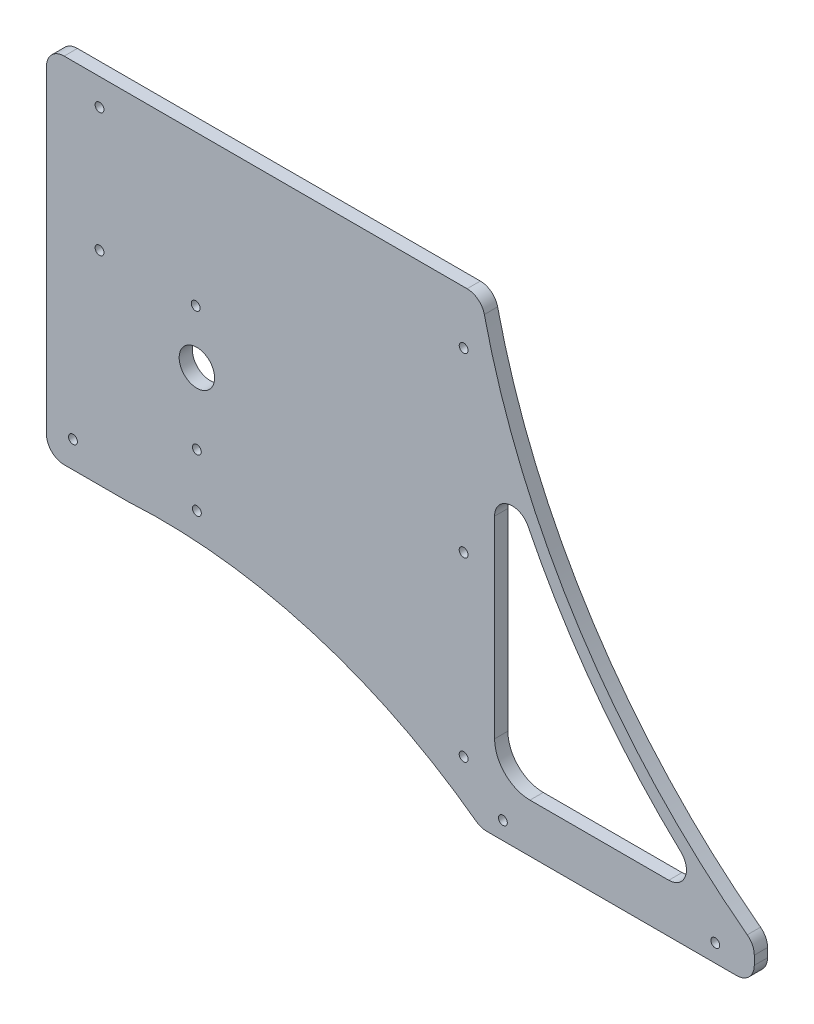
ISO-10303-21;
HEADER;
FILE_DESCRIPTION(('STEP AP214'),'2;1');
FILE_NAME('part.step','',(''),(''),'','','');
FILE_SCHEMA(('AUTOMOTIVE_DESIGN { 1 0 10303 214 1 1 1 1 }'));
ENDSEC;
DATA;
#1=APPLICATION_CONTEXT('core data for automotive mechanical design processes');
#2=APPLICATION_PROTOCOL_DEFINITION('international standard','automotive_design',2000,#1);
#3=PRODUCT_CONTEXT('',#1,'mechanical');
#4=PRODUCT('Part','Part','',(#3));
#5=PRODUCT_RELATED_PRODUCT_CATEGORY('part','',(#4));
#6=PRODUCT_DEFINITION_FORMATION('','',#4);
#7=PRODUCT_DEFINITION_CONTEXT('part definition',#1,'design');
#8=PRODUCT_DEFINITION('design','',#6,#7);
#9=PRODUCT_DEFINITION_SHAPE('','',#8);
#10=(LENGTH_UNIT() NAMED_UNIT(*) SI_UNIT(.MILLI.,.METRE.));
#11=(NAMED_UNIT(*) PLANE_ANGLE_UNIT() SI_UNIT($,.RADIAN.));
#12=(NAMED_UNIT(*) SI_UNIT($,.STERADIAN.) SOLID_ANGLE_UNIT());
#13=UNCERTAINTY_MEASURE_WITH_UNIT(LENGTH_MEASURE(1.E-05),#10,'distance_accuracy_value','');
#14=(GEOMETRIC_REPRESENTATION_CONTEXT(3) GLOBAL_UNCERTAINTY_ASSIGNED_CONTEXT((#13)) GLOBAL_UNIT_ASSIGNED_CONTEXT((#10,
#11,#12)) REPRESENTATION_CONTEXT('',''));
#15=CARTESIAN_POINT('',(0.,0.,0.));
#16=DIRECTION('',(0.,0.,1.));
#17=DIRECTION('',(1.,0.,0.));
#18=AXIS2_PLACEMENT_3D('',#15,#16,#17);
#19=CARTESIAN_POINT('',(0.,654.100000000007,9.525));
#20=DIRECTION('',(0.,1.,0.));
#21=DIRECTION('',(0.,0.,1.));
#22=AXIS2_PLACEMENT_3D('',#19,#20,#21);
#23=PLANE('',#22);
#24=DIRECTION('',(1.,0.,0.));
#25=VECTOR('',#24,1.);
#26=CARTESIAN_POINT('',(0.,654.100000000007,0.));
#27=LINE('',#26,#25);
#28=CARTESIAN_POINT('',(-120.65,654.100000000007,0.));
#29=VERTEX_POINT('',#28);
#30=CARTESIAN_POINT('',(168.540194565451,654.100000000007,0.));
#31=VERTEX_POINT('',#30);
#32=EDGE_CURVE('E259',#29,#31,#27,.T.);
#33=ORIENTED_EDGE('',*,*,#32,.F.);
#34=DIRECTION('',(0.,0.,-1.));
#35=VECTOR('',#34,1.);
#36=CARTESIAN_POINT('',(-120.65,654.100000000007,9.525));
#37=LINE('',#36,#35);
#38=CARTESIAN_POINT('',(-120.65,654.100000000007,9.525));
#39=VERTEX_POINT('',#38);
#40=EDGE_CURVE('E370',#29,#39,#37,.F.);
#41=ORIENTED_EDGE('',*,*,#40,.T.);
#42=DIRECTION('',(1.,0.,0.));
#43=VECTOR('',#42,1.);
#44=CARTESIAN_POINT('',(0.,654.100000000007,9.525));
#45=LINE('',#44,#43);
#46=CARTESIAN_POINT('',(168.540194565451,654.100000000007,9.525));
#47=VERTEX_POINT('',#46);
#48=EDGE_CURVE('E328',#39,#47,#45,.T.);
#49=ORIENTED_EDGE('',*,*,#48,.T.);
#50=DIRECTION('',(0.,0.,1.));
#51=VECTOR('',#50,1.);
#52=CARTESIAN_POINT('',(168.540194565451,654.100000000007,9.525));
#53=LINE('',#52,#51);
#54=EDGE_CURVE('E368',#47,#31,#53,.F.);
#55=ORIENTED_EDGE('',*,*,#54,.T.);
#56=EDGE_LOOP('',(#33,#41,#49,#55));
#57=FACE_BOUND('',#56,.T.);
#58=ADVANCED_FACE('F62',(#57),#23,.T.);
#59=CARTESIAN_POINT('',(374.65,0.,9.525));
#60=DIRECTION('',(1.,0.,0.));
#61=DIRECTION('',(0.,0.,-1.));
#62=AXIS2_PLACEMENT_3D('',#59,#60,#61);
#63=PLANE('',#62);
#64=DIRECTION('',(0.,-1.,0.));
#65=VECTOR('',#64,1.);
#66=CARTESIAN_POINT('',(374.65,0.,0.));
#67=LINE('',#66,#65);
#68=CARTESIAN_POINT('',(374.65,342.931246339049,0.));
#69=VERTEX_POINT('',#68);
#70=CARTESIAN_POINT('',(374.65,336.600000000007,0.));
#71=VERTEX_POINT('',#70);
#72=EDGE_CURVE('E332',#69,#71,#67,.T.);
#73=ORIENTED_EDGE('',*,*,#72,.F.);
#74=DIRECTION('',(0.,0.,1.));
#75=VECTOR('',#74,1.);
#76=CARTESIAN_POINT('',(374.65,342.931246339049,9.525));
#77=LINE('',#76,#75);
#78=CARTESIAN_POINT('',(374.65,342.931246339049,9.525));
#79=VERTEX_POINT('',#78);
#80=EDGE_CURVE('E391',#69,#79,#77,.T.);
#81=ORIENTED_EDGE('',*,*,#80,.T.);
#82=DIRECTION('',(0.,-1.,0.));
#83=VECTOR('',#82,1.);
#84=CARTESIAN_POINT('',(374.65,0.,9.525));
#85=LINE('',#84,#83);
#86=CARTESIAN_POINT('',(374.65,336.600000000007,9.525));
#87=VERTEX_POINT('',#86);
#88=EDGE_CURVE('E337',#79,#87,#85,.T.);
#89=ORIENTED_EDGE('',*,*,#88,.T.);
#90=DIRECTION('',(0.,0.,-1.));
#91=VECTOR('',#90,1.);
#92=CARTESIAN_POINT('',(374.65,336.600000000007,0.));
#93=LINE('',#92,#91);
#94=EDGE_CURVE('E388',#87,#71,#93,.T.);
#95=ORIENTED_EDGE('',*,*,#94,.T.);
#96=EDGE_LOOP('',(#73,#81,#89,#95));
#97=FACE_BOUND('',#96,.T.);
#98=ADVANCED_FACE('F449',(#97),#63,.T.);
#99=CARTESIAN_POINT('',(0.,0.,9.525));
#100=DIRECTION('',(0.,0.,1.));
#101=DIRECTION('',(1.,0.,0.));
#102=AXIS2_PLACEMENT_3D('',#99,#100,#101);
#103=PLANE('',#102);
#104=ORIENTED_EDGE('',*,*,#48,.F.);
#105=CARTESIAN_POINT('',(-120.65,641.400000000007,9.525));
#106=DIRECTION('',(0.,0.,1.));
#107=DIRECTION('',(1.,0.,0.));
#108=AXIS2_PLACEMENT_3D('',#105,#106,#107);
#109=CIRCLE('',#108,12.7);
#110=CARTESIAN_POINT('',(-133.35,641.400000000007,9.525));
#111=VERTEX_POINT('',#110);
#112=EDGE_CURVE('E381',#39,#111,#109,.T.);
#113=ORIENTED_EDGE('',*,*,#112,.T.);
#114=DIRECTION('',(0.,-1.,0.));
#115=VECTOR('',#114,1.);
#116=CARTESIAN_POINT('',(-133.35,0.,9.525));
#117=LINE('',#116,#115);
#118=CARTESIAN_POINT('',(-133.35,412.800000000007,9.525));
#119=VERTEX_POINT('',#118);
#120=EDGE_CURVE('E331',#111,#119,#117,.T.);
#121=ORIENTED_EDGE('',*,*,#120,.T.);
#122=CARTESIAN_POINT('',(-120.65,412.800000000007,9.525));
#123=DIRECTION('',(0.,0.,1.));
#124=DIRECTION('',(1.,0.,0.));
#125=AXIS2_PLACEMENT_3D('',#122,#123,#124);
#126=CIRCLE('',#125,12.7);
#127=CARTESIAN_POINT('',(-120.65,400.100000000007,9.525));
#128=VERTEX_POINT('',#127);
#129=EDGE_CURVE('E219',#119,#128,#126,.T.);
#130=ORIENTED_EDGE('',*,*,#129,.T.);
#131=DIRECTION('',(-1.,0.,0.));
#132=VECTOR('',#131,1.);
#133=CARTESIAN_POINT('',(-1.96303981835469E-13,400.100000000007,9.525));
#134=LINE('',#133,#132);
#135=CARTESIAN_POINT('',(-74.6125,400.100000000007,9.525));
#136=VERTEX_POINT('',#135);
#137=EDGE_CURVE('E203',#136,#128,#134,.T.);
#138=ORIENTED_EDGE('',*,*,#137,.F.);
#139=CARTESIAN_POINT('',(-51.2067437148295,19.819615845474,9.525));
#140=DIRECTION('',(0.,0.,1.));
#141=DIRECTION('',(1.,0.,0.));
#142=AXIS2_PLACEMENT_3D('',#139,#140,#141);
#143=CIRCLE('',#142,381.);
#144=CARTESIAN_POINT('',(175.025321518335,326.381277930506,9.525));
#145=VERTEX_POINT('',#144);
#146=EDGE_CURVE('E194',#145,#136,#143,.T.);
#147=ORIENTED_EDGE('',*,*,#146,.F.);
#148=CARTESIAN_POINT('',(182.56639035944,336.600000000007,9.525));
#149=DIRECTION('',(0.,0.,1.));
#150=DIRECTION('',(1.,0.,0.));
#151=AXIS2_PLACEMENT_3D('',#148,#149,#150);
#152=CIRCLE('',#151,12.7);
#153=CARTESIAN_POINT('',(182.56639035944,323.900000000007,9.525));
#154=VERTEX_POINT('',#153);
#155=EDGE_CURVE('E373',#145,#154,#152,.T.);
#156=ORIENTED_EDGE('',*,*,#155,.T.);
#157=DIRECTION('',(1.,0.,0.));
#158=VECTOR('',#157,1.);
#159=CARTESIAN_POINT('',(0.,323.900000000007,9.525));
#160=LINE('',#159,#158);
#161=CARTESIAN_POINT('',(361.95,323.900000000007,9.525));
#162=VERTEX_POINT('',#161);
#163=EDGE_CURVE('E334',#154,#162,#160,.T.);
#164=ORIENTED_EDGE('',*,*,#163,.T.);
#165=CARTESIAN_POINT('',(361.95,336.600000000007,9.525));
#166=DIRECTION('',(0.,0.,1.));
#167=DIRECTION('',(1.,0.,0.));
#168=AXIS2_PLACEMENT_3D('',#165,#166,#167);
#169=CIRCLE('',#168,12.7);
#170=EDGE_CURVE('E375',#162,#87,#169,.T.);
#171=ORIENTED_EDGE('',*,*,#170,.T.);
#172=ORIENTED_EDGE('',*,*,#88,.F.);
#173=CARTESIAN_POINT('',(361.95,342.931246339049,9.525));
#174=DIRECTION('',(0.,0.,1.));
#175=DIRECTION('',(1.,0.,0.));
#176=AXIS2_PLACEMENT_3D('',#173,#174,#175);
#177=CIRCLE('',#176,12.7);
#178=CARTESIAN_POINT('',(369.608472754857,353.062277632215,9.525));
#179=VERTEX_POINT('',#178);
#180=EDGE_CURVE('E377',#79,#179,#177,.T.);
#181=ORIENTED_EDGE('',*,*,#180,.T.);
#182=CARTESIAN_POINT('',(675.947382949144,758.303529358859,9.525));
#183=DIRECTION('',(0.,0.,1.));
#184=DIRECTION('',(1.,0.,0.));
#185=AXIS2_PLACEMENT_3D('',#182,#183,#184);
#186=CIRCLE('',#185,508.);
#187=CARTESIAN_POINT('',(180.91597964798,644.251305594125,9.525));
#188=VERTEX_POINT('',#187);
#189=EDGE_CURVE('E229',#179,#188,#186,.F.);
#190=ORIENTED_EDGE('',*,*,#189,.T.);
#191=CARTESIAN_POINT('',(168.540194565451,641.400000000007,9.525));
#192=DIRECTION('',(0.,0.,1.));
#193=DIRECTION('',(1.,0.,0.));
#194=AXIS2_PLACEMENT_3D('',#191,#192,#193);
#195=CIRCLE('',#194,12.7);
#196=EDGE_CURVE('E379',#188,#47,#195,.T.);
#197=ORIENTED_EDGE('',*,*,#196,.T.);
#198=EDGE_LOOP('',(#104,#113,#121,#130,#138,#147,#156,#164,#171,#172,#181,#190,#197));
#199=FACE_BOUND('',#198,.T.);
#200=CARTESIAN_POINT('',(-95.25,635.,9.525));
#201=DIRECTION('',(0.,0.,1.));
#202=DIRECTION('',(1.,0.,0.));
#203=AXIS2_PLACEMENT_3D('',#200,#201,#202);
#204=CIRCLE('',#203,3.17500000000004);
#205=CARTESIAN_POINT('',(-92.075,635.,9.525));
#206=VERTEX_POINT('',#205);
#207=EDGE_CURVE('E260',#206,#206,#204,.T.);
#208=ORIENTED_EDGE('',*,*,#207,.F.);
#209=EDGE_LOOP('',(#208));
#210=FACE_BOUND('',#209,.T.);
#211=CARTESIAN_POINT('',(166.04961096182,489.000000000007,9.525));
#212=DIRECTION('',(0.,0.,1.));
#213=DIRECTION('',(1.,0.,0.));
#214=AXIS2_PLACEMENT_3D('',#211,#212,#213);
#215=CIRCLE('',#214,3.175);
#216=CARTESIAN_POINT('',(169.22461096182,489.000000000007,9.525));
#217=VERTEX_POINT('',#216);
#218=EDGE_CURVE('E286',#217,#217,#215,.T.);
#219=ORIENTED_EDGE('',*,*,#218,.F.);
#220=EDGE_LOOP('',(#219));
#221=FACE_BOUND('',#220,.T.);
#222=CARTESIAN_POINT('',(166.04961096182,616.000000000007,9.525));
#223=DIRECTION('',(0.,0.,1.));
#224=DIRECTION('',(1.,0.,0.));
#225=AXIS2_PLACEMENT_3D('',#222,#223,#224);
#226=CIRCLE('',#225,3.175);
#227=CARTESIAN_POINT('',(169.22461096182,616.000000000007,9.525));
#228=VERTEX_POINT('',#227);
#229=EDGE_CURVE('E280',#228,#228,#226,.T.);
#230=ORIENTED_EDGE('',*,*,#229,.F.);
#231=EDGE_LOOP('',(#230));
#232=FACE_BOUND('',#231,.T.);
#233=CARTESIAN_POINT('',(-25.4,457.2,9.525));
#234=DIRECTION('',(0.,0.,1.));
#235=DIRECTION('',(1.,0.,0.));
#236=AXIS2_PLACEMENT_3D('',#233,#234,#235);
#237=CIRCLE('',#236,3.17499999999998);
#238=CARTESIAN_POINT('',(-22.225,457.2,9.525));
#239=VERTEX_POINT('',#238);
#240=EDGE_CURVE('E274',#239,#239,#237,.T.);
#241=ORIENTED_EDGE('',*,*,#240,.F.);
#242=EDGE_LOOP('',(#241));
#243=FACE_BOUND('',#242,.T.);
#244=CARTESIAN_POINT('',(-25.4,419.1,9.525));
#245=DIRECTION('',(0.,0.,1.));
#246=DIRECTION('',(1.,0.,0.));
#247=AXIS2_PLACEMENT_3D('',#244,#245,#246);
#248=CIRCLE('',#247,3.17499999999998);
#249=CARTESIAN_POINT('',(-22.225,419.1,9.525));
#250=VERTEX_POINT('',#249);
#251=EDGE_CURVE('E268',#250,#250,#248,.T.);
#252=ORIENTED_EDGE('',*,*,#251,.F.);
#253=EDGE_LOOP('',(#252));
#254=FACE_BOUND('',#253,.T.);
#255=CARTESIAN_POINT('',(-114.3,419.1,9.525));
#256=DIRECTION('',(0.,0.,1.));
#257=DIRECTION('',(1.,0.,0.));
#258=AXIS2_PLACEMENT_3D('',#255,#256,#257);
#259=CIRCLE('',#258,3.17499999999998);
#260=CARTESIAN_POINT('',(-111.125,419.1,9.525));
#261=VERTEX_POINT('',#260);
#262=EDGE_CURVE('E267',#261,#261,#259,.T.);
#263=ORIENTED_EDGE('',*,*,#262,.F.);
#264=EDGE_LOOP('',(#263));
#265=FACE_BOUND('',#264,.T.);
#266=CARTESIAN_POINT('',(-25.4,508.,9.525));
#267=DIRECTION('',(0.,0.,1.));
#268=DIRECTION('',(1.,0.,0.));
#269=AXIS2_PLACEMENT_3D('',#266,#267,#268);
#270=CIRCLE('',#269,12.7);
#271=CARTESIAN_POINT('',(-12.7,508.,9.525));
#272=VERTEX_POINT('',#271);
#273=EDGE_CURVE('E304',#272,#272,#270,.T.);
#274=ORIENTED_EDGE('',*,*,#273,.F.);
#275=EDGE_LOOP('',(#274));
#276=FACE_BOUND('',#275,.T.);
#277=CARTESIAN_POINT('',(-26.252614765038,546.090458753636,9.525));
#278=DIRECTION('',(0.,0.,1.));
#279=DIRECTION('',(1.,0.,0.));
#280=AXIS2_PLACEMENT_3D('',#277,#278,#279);
#281=CIRCLE('',#280,3.17500000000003);
#282=CARTESIAN_POINT('',(-23.0776147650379,546.090458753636,9.525));
#283=VERTEX_POINT('',#282);
#284=EDGE_CURVE('E298',#283,#283,#281,.T.);
#285=ORIENTED_EDGE('',*,*,#284,.F.);
#286=EDGE_LOOP('',(#285));
#287=FACE_BOUND('',#286,.T.);
#288=CARTESIAN_POINT('',(-95.25,546.1,9.525));
#289=DIRECTION('',(0.,0.,1.));
#290=DIRECTION('',(1.,0.,0.));
#291=AXIS2_PLACEMENT_3D('',#288,#289,#290);
#292=CIRCLE('',#291,3.17500000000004);
#293=CARTESIAN_POINT('',(-92.075,546.1,9.525));
#294=VERTEX_POINT('',#293);
#295=EDGE_CURVE('E292',#294,#294,#292,.T.);
#296=ORIENTED_EDGE('',*,*,#295,.F.);
#297=EDGE_LOOP('',(#296));
#298=FACE_BOUND('',#297,.T.);
#299=CARTESIAN_POINT('',(166.04961096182,362.000000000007,9.525));
#300=DIRECTION('',(0.,0.,1.));
#301=DIRECTION('',(1.,0.,0.));
#302=AXIS2_PLACEMENT_3D('',#299,#300,#301);
#303=CIRCLE('',#302,3.175);
#304=CARTESIAN_POINT('',(169.22461096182,362.000000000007,9.525));
#305=VERTEX_POINT('',#304);
#306=EDGE_CURVE('E314',#305,#305,#303,.T.);
#307=ORIENTED_EDGE('',*,*,#306,.F.);
#308=EDGE_LOOP('',(#307));
#309=FACE_BOUND('',#308,.T.);
#310=CARTESIAN_POINT('',(194.24121622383,336.600000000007,9.525));
#311=DIRECTION('',(0.,0.,1.));
#312=DIRECTION('',(1.,0.,0.));
#313=AXIS2_PLACEMENT_3D('',#310,#311,#312);
#314=CIRCLE('',#313,3.175);
#315=CARTESIAN_POINT('',(197.41621622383,336.600000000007,9.525));
#316=VERTEX_POINT('',#315);
#317=EDGE_CURVE('E320',#316,#316,#314,.T.);
#318=ORIENTED_EDGE('',*,*,#317,.F.);
#319=EDGE_LOOP('',(#318));
#320=FACE_BOUND('',#319,.T.);
#321=CARTESIAN_POINT('',(346.64121622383,336.600000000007,9.525));
#322=DIRECTION('',(0.,0.,1.));
#323=DIRECTION('',(1.,0.,0.));
#324=AXIS2_PLACEMENT_3D('',#321,#322,#323);
#325=CIRCLE('',#324,3.17500000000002);
#326=CARTESIAN_POINT('',(349.81621622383,336.600000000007,9.525));
#327=VERTEX_POINT('',#326);
#328=EDGE_CURVE('E213',#327,#327,#325,.T.);
#329=ORIENTED_EDGE('',*,*,#328,.F.);
#330=EDGE_LOOP('',(#329));
#331=FACE_BOUND('',#330,.T.);
#332=DIRECTION('',(1.,0.,0.));
#333=VECTOR('',#332,1.);
#334=CARTESIAN_POINT('',(0.,358.825000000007,9.525));
#335=LINE('',#334,#333);
#336=CARTESIAN_POINT('',(213.67461096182,358.825000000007,9.525));
#337=VERTEX_POINT('',#336);
#338=CARTESIAN_POINT('',(313.261678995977,358.825000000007,9.525));
#339=VERTEX_POINT('',#338);
#340=EDGE_CURVE('E246',#337,#339,#335,.T.);
#341=ORIENTED_EDGE('',*,*,#340,.F.);
#342=CARTESIAN_POINT('',(213.67461096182,384.225000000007,9.525));
#343=DIRECTION('',(0.,0.,1.));
#344=DIRECTION('',(1.,0.,0.));
#345=AXIS2_PLACEMENT_3D('',#342,#343,#344);
#346=CIRCLE('',#345,25.4);
#347=CARTESIAN_POINT('',(188.27461096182,384.225000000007,9.525));
#348=VERTEX_POINT('',#347);
#349=EDGE_CURVE('E228',#337,#348,#346,.F.);
#350=ORIENTED_EDGE('',*,*,#349,.T.);
#351=DIRECTION('',(0.,-1.,0.));
#352=VECTOR('',#351,1.);
#353=CARTESIAN_POINT('',(188.27461096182,0.,9.525));
#354=LINE('',#353,#352);
#355=CARTESIAN_POINT('',(188.27461096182,522.635507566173,9.525));
#356=VERTEX_POINT('',#355);
#357=EDGE_CURVE('E236',#356,#348,#354,.T.);
#358=ORIENTED_EDGE('',*,*,#357,.F.);
#359=CARTESIAN_POINT('',(200.97461096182,522.635507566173,9.525));
#360=DIRECTION('',(0.,0.,1.));
#361=DIRECTION('',(1.,0.,0.));
#362=AXIS2_PLACEMENT_3D('',#359,#360,#361);
#363=CIRCLE('',#362,12.7);
#364=CARTESIAN_POINT('',(212.351204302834,528.280250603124,9.525));
#365=VERTEX_POINT('',#364);
#366=EDGE_CURVE('E410',#356,#365,#363,.F.);
#367=ORIENTED_EDGE('',*,*,#366,.T.);
#368=CARTESIAN_POINT('',(675.947382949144,758.303529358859,9.525));
#369=DIRECTION('',(0.,0.,1.));
#370=DIRECTION('',(1.,0.,0.));
#371=AXIS2_PLACEMENT_3D('',#368,#369,#370);
#372=CIRCLE('',#371,517.525);
#373=CARTESIAN_POINT('',(321.948761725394,380.789156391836,9.525));
#374=VERTEX_POINT('',#373);
#375=EDGE_CURVE('E248',#374,#365,#372,.F.);
#376=ORIENTED_EDGE('',*,*,#375,.F.);
#377=CARTESIAN_POINT('',(313.261678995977,371.525000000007,9.525));
#378=DIRECTION('',(0.,0.,1.));
#379=DIRECTION('',(1.,0.,0.));
#380=AXIS2_PLACEMENT_3D('',#377,#378,#379);
#381=CIRCLE('',#380,12.7);
#382=EDGE_CURVE('E70',#374,#339,#381,.F.);
#383=ORIENTED_EDGE('',*,*,#382,.T.);
#384=EDGE_LOOP('',(#341,#350,#358,#367,#376,#383));
#385=FACE_BOUND('',#384,.T.);
#386=ADVANCED_FACE('F216',(#199,#210,#221,#232,#243,#254,#265,#276,#287,#298,#309,#320,#331,
#385),#103,.T.);
#387=CARTESIAN_POINT('',(0.,0.,0.));
#388=DIRECTION('',(0.,0.,1.));
#389=DIRECTION('',(1.,0.,0.));
#390=AXIS2_PLACEMENT_3D('',#387,#388,#389);
#391=PLANE('',#390);
#392=CARTESIAN_POINT('',(213.67461096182,384.225000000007,0.));
#393=DIRECTION('',(0.,0.,1.));
#394=DIRECTION('',(1.,0.,0.));
#395=AXIS2_PLACEMENT_3D('',#392,#393,#394);
#396=CIRCLE('',#395,25.4);
#397=CARTESIAN_POINT('',(213.67461096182,358.825000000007,0.));
#398=VERTEX_POINT('',#397);
#399=CARTESIAN_POINT('',(188.27461096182,384.225000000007,0.));
#400=VERTEX_POINT('',#399);
#401=EDGE_CURVE('E232',#398,#400,#396,.F.);
#402=ORIENTED_EDGE('',*,*,#401,.F.);
#403=DIRECTION('',(1.,0.,0.));
#404=VECTOR('',#403,1.);
#405=CARTESIAN_POINT('',(0.,358.825000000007,0.));
#406=LINE('',#405,#404);
#407=CARTESIAN_POINT('',(313.261678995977,358.825000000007,0.));
#408=VERTEX_POINT('',#407);
#409=EDGE_CURVE('E235',#398,#408,#406,.T.);
#410=ORIENTED_EDGE('',*,*,#409,.T.);
#411=CARTESIAN_POINT('',(313.261678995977,371.525000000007,0.));
#412=DIRECTION('',(0.,0.,1.));
#413=DIRECTION('',(1.,0.,0.));
#414=AXIS2_PLACEMENT_3D('',#411,#412,#413);
#415=CIRCLE('',#414,12.7);
#416=CARTESIAN_POINT('',(321.948761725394,380.789156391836,0.));
#417=VERTEX_POINT('',#416);
#418=EDGE_CURVE('E12',#408,#417,#415,.T.);
#419=ORIENTED_EDGE('',*,*,#418,.T.);
#420=CARTESIAN_POINT('',(675.947382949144,758.303529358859,0.));
#421=DIRECTION('',(0.,0.,1.));
#422=DIRECTION('',(1.,0.,0.));
#423=AXIS2_PLACEMENT_3D('',#420,#421,#422);
#424=CIRCLE('',#423,517.525);
#425=CARTESIAN_POINT('',(212.351204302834,528.280250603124,0.));
#426=VERTEX_POINT('',#425);
#427=EDGE_CURVE('E238',#417,#426,#424,.F.);
#428=ORIENTED_EDGE('',*,*,#427,.T.);
#429=CARTESIAN_POINT('',(200.97461096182,522.635507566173,0.));
#430=DIRECTION('',(0.,0.,1.));
#431=DIRECTION('',(1.,0.,0.));
#432=AXIS2_PLACEMENT_3D('',#429,#430,#431);
#433=CIRCLE('',#432,12.7);
#434=CARTESIAN_POINT('',(188.27461096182,522.635507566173,0.));
#435=VERTEX_POINT('',#434);
#436=EDGE_CURVE('E412',#426,#435,#433,.T.);
#437=ORIENTED_EDGE('',*,*,#436,.T.);
#438=DIRECTION('',(0.,-1.,0.));
#439=VECTOR('',#438,1.);
#440=CARTESIAN_POINT('',(188.27461096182,0.,0.));
#441=LINE('',#440,#439);
#442=EDGE_CURVE('E241',#435,#400,#441,.T.);
#443=ORIENTED_EDGE('',*,*,#442,.T.);
#444=EDGE_LOOP('',(#402,#410,#419,#428,#437,#443));
#445=FACE_BOUND('',#444,.T.);
#446=CARTESIAN_POINT('',(-95.25,635.,0.));
#447=DIRECTION('',(0.,0.,1.));
#448=DIRECTION('',(1.,0.,0.));
#449=AXIS2_PLACEMENT_3D('',#446,#447,#448);
#450=CIRCLE('',#449,3.17500000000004);
#451=CARTESIAN_POINT('',(-92.075,635.,0.));
#452=VERTEX_POINT('',#451);
#453=EDGE_CURVE('E256',#452,#452,#450,.T.);
#454=ORIENTED_EDGE('',*,*,#453,.T.);
#455=EDGE_LOOP('',(#454));
#456=FACE_BOUND('',#455,.T.);
#457=CARTESIAN_POINT('',(166.04961096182,489.000000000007,0.));
#458=DIRECTION('',(0.,0.,1.));
#459=DIRECTION('',(1.,0.,0.));
#460=AXIS2_PLACEMENT_3D('',#457,#458,#459);
#461=CIRCLE('',#460,3.175);
#462=CARTESIAN_POINT('',(169.22461096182,489.000000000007,0.));
#463=VERTEX_POINT('',#462);
#464=EDGE_CURVE('E283',#463,#463,#461,.T.);
#465=ORIENTED_EDGE('',*,*,#464,.T.);
#466=EDGE_LOOP('',(#465));
#467=FACE_BOUND('',#466,.T.);
#468=CARTESIAN_POINT('',(166.04961096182,616.000000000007,0.));
#469=DIRECTION('',(0.,0.,1.));
#470=DIRECTION('',(1.,0.,0.));
#471=AXIS2_PLACEMENT_3D('',#468,#469,#470);
#472=CIRCLE('',#471,3.175);
#473=CARTESIAN_POINT('',(169.22461096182,616.000000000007,0.));
#474=VERTEX_POINT('',#473);
#475=EDGE_CURVE('E277',#474,#474,#472,.T.);
#476=ORIENTED_EDGE('',*,*,#475,.T.);
#477=EDGE_LOOP('',(#476));
#478=FACE_BOUND('',#477,.T.);
#479=CARTESIAN_POINT('',(-25.4,457.2,0.));
#480=DIRECTION('',(0.,0.,1.));
#481=DIRECTION('',(1.,0.,0.));
#482=AXIS2_PLACEMENT_3D('',#479,#480,#481);
#483=CIRCLE('',#482,3.17499999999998);
#484=CARTESIAN_POINT('',(-22.225,457.2,0.));
#485=VERTEX_POINT('',#484);
#486=EDGE_CURVE('E271',#485,#485,#483,.T.);
#487=ORIENTED_EDGE('',*,*,#486,.T.);
#488=EDGE_LOOP('',(#487));
#489=FACE_BOUND('',#488,.T.);
#490=CARTESIAN_POINT('',(-25.4,419.1,0.));
#491=DIRECTION('',(0.,0.,1.));
#492=DIRECTION('',(1.,0.,0.));
#493=AXIS2_PLACEMENT_3D('',#490,#491,#492);
#494=CIRCLE('',#493,3.17499999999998);
#495=CARTESIAN_POINT('',(-22.225,419.1,0.));
#496=VERTEX_POINT('',#495);
#497=EDGE_CURVE('E264',#496,#496,#494,.T.);
#498=ORIENTED_EDGE('',*,*,#497,.T.);
#499=EDGE_LOOP('',(#498));
#500=FACE_BOUND('',#499,.T.);
#501=CARTESIAN_POINT('',(-114.3,419.1,0.));
#502=DIRECTION('',(0.,0.,1.));
#503=DIRECTION('',(1.,0.,0.));
#504=AXIS2_PLACEMENT_3D('',#501,#502,#503);
#505=CIRCLE('',#504,3.17499999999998);
#506=CARTESIAN_POINT('',(-111.125,419.1,0.));
#507=VERTEX_POINT('',#506);
#508=EDGE_CURVE('E307',#507,#507,#505,.T.);
#509=ORIENTED_EDGE('',*,*,#508,.T.);
#510=EDGE_LOOP('',(#509));
#511=FACE_BOUND('',#510,.T.);
#512=CARTESIAN_POINT('',(-25.4,508.,0.));
#513=DIRECTION('',(0.,0.,1.));
#514=DIRECTION('',(1.,0.,0.));
#515=AXIS2_PLACEMENT_3D('',#512,#513,#514);
#516=CIRCLE('',#515,12.7);
#517=CARTESIAN_POINT('',(-12.7,508.,0.));
#518=VERTEX_POINT('',#517);
#519=EDGE_CURVE('E301',#518,#518,#516,.T.);
#520=ORIENTED_EDGE('',*,*,#519,.T.);
#521=EDGE_LOOP('',(#520));
#522=FACE_BOUND('',#521,.T.);
#523=CARTESIAN_POINT('',(-26.252614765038,546.090458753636,0.));
#524=DIRECTION('',(0.,0.,1.));
#525=DIRECTION('',(1.,0.,0.));
#526=AXIS2_PLACEMENT_3D('',#523,#524,#525);
#527=CIRCLE('',#526,3.17500000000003);
#528=CARTESIAN_POINT('',(-23.0776147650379,546.090458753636,0.));
#529=VERTEX_POINT('',#528);
#530=EDGE_CURVE('E295',#529,#529,#527,.T.);
#531=ORIENTED_EDGE('',*,*,#530,.T.);
#532=EDGE_LOOP('',(#531));
#533=FACE_BOUND('',#532,.T.);
#534=CARTESIAN_POINT('',(-95.25,546.1,0.));
#535=DIRECTION('',(0.,0.,1.));
#536=DIRECTION('',(1.,0.,0.));
#537=AXIS2_PLACEMENT_3D('',#534,#535,#536);
#538=CIRCLE('',#537,3.17500000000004);
#539=CARTESIAN_POINT('',(-92.075,546.1,0.));
#540=VERTEX_POINT('',#539);
#541=EDGE_CURVE('E263',#540,#540,#538,.T.);
#542=ORIENTED_EDGE('',*,*,#541,.T.);
#543=EDGE_LOOP('',(#542));
#544=FACE_BOUND('',#543,.T.);
#545=CARTESIAN_POINT('',(166.04961096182,362.000000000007,0.));
#546=DIRECTION('',(0.,0.,1.));
#547=DIRECTION('',(1.,0.,0.));
#548=AXIS2_PLACEMENT_3D('',#545,#546,#547);
#549=CIRCLE('',#548,3.175);
#550=CARTESIAN_POINT('',(169.22461096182,362.000000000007,0.));
#551=VERTEX_POINT('',#550);
#552=EDGE_CURVE('E289',#551,#551,#549,.T.);
#553=ORIENTED_EDGE('',*,*,#552,.T.);
#554=EDGE_LOOP('',(#553));
#555=FACE_BOUND('',#554,.T.);
#556=CARTESIAN_POINT('',(194.24121622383,336.600000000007,0.));
#557=DIRECTION('',(0.,0.,1.));
#558=DIRECTION('',(1.,0.,0.));
#559=AXIS2_PLACEMENT_3D('',#556,#557,#558);
#560=CIRCLE('',#559,3.175);
#561=CARTESIAN_POINT('',(197.41621622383,336.600000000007,0.));
#562=VERTEX_POINT('',#561);
#563=EDGE_CURVE('E317',#562,#562,#560,.T.);
#564=ORIENTED_EDGE('',*,*,#563,.T.);
#565=EDGE_LOOP('',(#564));
#566=FACE_BOUND('',#565,.T.);
#567=CARTESIAN_POINT('',(346.64121622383,336.600000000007,0.));
#568=DIRECTION('',(0.,0.,1.));
#569=DIRECTION('',(1.,0.,0.));
#570=AXIS2_PLACEMENT_3D('',#567,#568,#569);
#571=CIRCLE('',#570,3.17500000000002);
#572=CARTESIAN_POINT('',(349.81621622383,336.600000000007,0.));
#573=VERTEX_POINT('',#572);
#574=EDGE_CURVE('E323',#573,#573,#571,.T.);
#575=ORIENTED_EDGE('',*,*,#574,.T.);
#576=EDGE_LOOP('',(#575));
#577=FACE_BOUND('',#576,.T.);
#578=DIRECTION('',(0.,-1.,0.));
#579=VECTOR('',#578,1.);
#580=CARTESIAN_POINT('',(-133.35,0.,0.));
#581=LINE('',#580,#579);
#582=CARTESIAN_POINT('',(-133.35,641.400000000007,0.));
#583=VERTEX_POINT('',#582);
#584=CARTESIAN_POINT('',(-133.35,412.800000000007,0.));
#585=VERTEX_POINT('',#584);
#586=EDGE_CURVE('E343',#583,#585,#581,.T.);
#587=ORIENTED_EDGE('',*,*,#586,.F.);
#588=CARTESIAN_POINT('',(-120.65,641.400000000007,0.));
#589=DIRECTION('',(0.,0.,1.));
#590=DIRECTION('',(1.,0.,0.));
#591=AXIS2_PLACEMENT_3D('',#588,#589,#590);
#592=CIRCLE('',#591,12.7);
#593=EDGE_CURVE('E366',#583,#29,#592,.F.);
#594=ORIENTED_EDGE('',*,*,#593,.T.);
#595=ORIENTED_EDGE('',*,*,#32,.T.);
#596=CARTESIAN_POINT('',(168.540194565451,641.400000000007,0.));
#597=DIRECTION('',(0.,0.,1.));
#598=DIRECTION('',(1.,0.,0.));
#599=AXIS2_PLACEMENT_3D('',#596,#597,#598);
#600=CIRCLE('',#599,12.7);
#601=CARTESIAN_POINT('',(180.91597964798,644.251305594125,0.));
#602=VERTEX_POINT('',#601);
#603=EDGE_CURVE('E364',#31,#602,#600,.F.);
#604=ORIENTED_EDGE('',*,*,#603,.T.);
#605=CARTESIAN_POINT('',(675.947382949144,758.303529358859,0.));
#606=DIRECTION('',(0.,0.,1.));
#607=DIRECTION('',(1.,0.,0.));
#608=AXIS2_PLACEMENT_3D('',#605,#606,#607);
#609=CIRCLE('',#608,508.);
#610=CARTESIAN_POINT('',(369.608472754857,353.062277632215,0.));
#611=VERTEX_POINT('',#610);
#612=EDGE_CURVE('E225',#611,#602,#609,.F.);
#613=ORIENTED_EDGE('',*,*,#612,.F.);
#614=CARTESIAN_POINT('',(361.95,342.931246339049,0.));
#615=DIRECTION('',(0.,0.,1.));
#616=DIRECTION('',(1.,0.,0.));
#617=AXIS2_PLACEMENT_3D('',#614,#615,#616);
#618=CIRCLE('',#617,12.7);
#619=EDGE_CURVE('E362',#611,#69,#618,.F.);
#620=ORIENTED_EDGE('',*,*,#619,.T.);
#621=ORIENTED_EDGE('',*,*,#72,.T.);
#622=CARTESIAN_POINT('',(361.95,336.600000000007,0.));
#623=DIRECTION('',(0.,0.,1.));
#624=DIRECTION('',(1.,0.,0.));
#625=AXIS2_PLACEMENT_3D('',#622,#623,#624);
#626=CIRCLE('',#625,12.7);
#627=CARTESIAN_POINT('',(361.95,323.900000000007,0.));
#628=VERTEX_POINT('',#627);
#629=EDGE_CURVE('E360',#71,#628,#626,.F.);
#630=ORIENTED_EDGE('',*,*,#629,.T.);
#631=DIRECTION('',(1.,0.,0.));
#632=VECTOR('',#631,1.);
#633=CARTESIAN_POINT('',(0.,323.900000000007,0.));
#634=LINE('',#633,#632);
#635=CARTESIAN_POINT('',(182.56639035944,323.900000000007,0.));
#636=VERTEX_POINT('',#635);
#637=EDGE_CURVE('E346',#636,#628,#634,.T.);
#638=ORIENTED_EDGE('',*,*,#637,.F.);
#639=CARTESIAN_POINT('',(182.56639035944,336.600000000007,0.));
#640=DIRECTION('',(0.,0.,1.));
#641=DIRECTION('',(1.,0.,0.));
#642=AXIS2_PLACEMENT_3D('',#639,#640,#641);
#643=CIRCLE('',#642,12.7);
#644=CARTESIAN_POINT('',(175.025321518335,326.381277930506,0.));
#645=VERTEX_POINT('',#644);
#646=EDGE_CURVE('E358',#636,#645,#643,.F.);
#647=ORIENTED_EDGE('',*,*,#646,.T.);
#648=CARTESIAN_POINT('',(-51.2067437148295,19.819615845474,0.));
#649=DIRECTION('',(0.,0.,1.));
#650=DIRECTION('',(1.,0.,0.));
#651=AXIS2_PLACEMENT_3D('',#648,#649,#650);
#652=CIRCLE('',#651,381.);
#653=CARTESIAN_POINT('',(-74.6125,400.100000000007,0.));
#654=VERTEX_POINT('',#653);
#655=EDGE_CURVE('E220',#645,#654,#652,.T.);
#656=ORIENTED_EDGE('',*,*,#655,.T.);
#657=DIRECTION('',(-1.,0.,0.));
#658=VECTOR('',#657,1.);
#659=CARTESIAN_POINT('',(-1.96303981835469E-13,400.100000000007,0.));
#660=LINE('',#659,#658);
#661=CARTESIAN_POINT('',(-120.65,400.100000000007,0.));
#662=VERTEX_POINT('',#661);
#663=EDGE_CURVE('E212',#654,#662,#660,.T.);
#664=ORIENTED_EDGE('',*,*,#663,.T.);
#665=CARTESIAN_POINT('',(-120.65,412.800000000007,0.));
#666=DIRECTION('',(0.,0.,1.));
#667=DIRECTION('',(1.,0.,0.));
#668=AXIS2_PLACEMENT_3D('',#665,#666,#667);
#669=CIRCLE('',#668,12.7);
#670=EDGE_CURVE('E356',#662,#585,#669,.F.);
#671=ORIENTED_EDGE('',*,*,#670,.T.);
#672=EDGE_LOOP('',(#587,#594,#595,#604,#613,#620,#621,#630,#638,#647,#656,#664,#671));
#673=FACE_BOUND('',#672,.T.);
#674=ADVANCED_FACE('F417',(#445,#456,#467,#478,#489,#500,#511,#522,#533,#544,#555,#566,#577,
#673),#391,.F.);
#675=CARTESIAN_POINT('',(-133.35,0.,9.525));
#676=DIRECTION('',(1.,0.,0.));
#677=DIRECTION('',(0.,1.,0.));
#678=AXIS2_PLACEMENT_3D('',#675,#676,#677);
#679=PLANE('',#678);
#680=ORIENTED_EDGE('',*,*,#120,.F.);
#681=DIRECTION('',(0.,0.,-1.));
#682=VECTOR('',#681,1.);
#683=CARTESIAN_POINT('',(-133.35,641.400000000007,0.));
#684=LINE('',#683,#682);
#685=EDGE_CURVE('E353',#111,#583,#684,.T.);
#686=ORIENTED_EDGE('',*,*,#685,.T.);
#687=ORIENTED_EDGE('',*,*,#586,.T.);
#688=DIRECTION('',(0.,0.,1.));
#689=VECTOR('',#688,1.);
#690=CARTESIAN_POINT('',(-133.35,412.800000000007,9.525));
#691=LINE('',#690,#689);
#692=EDGE_CURVE('E340',#585,#119,#691,.T.);
#693=ORIENTED_EDGE('',*,*,#692,.T.);
#694=EDGE_LOOP('',(#680,#686,#687,#693));
#695=FACE_BOUND('',#694,.T.);
#696=ADVANCED_FACE('F460',(#695),#679,.F.);
#697=CARTESIAN_POINT('',(0.,323.900000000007,9.525));
#698=DIRECTION('',(0.,1.,0.));
#699=DIRECTION('',(0.,0.,1.));
#700=AXIS2_PLACEMENT_3D('',#697,#698,#699);
#701=PLANE('',#700);
#702=ORIENTED_EDGE('',*,*,#637,.T.);
#703=DIRECTION('',(0.,0.,-1.));
#704=VECTOR('',#703,1.);
#705=CARTESIAN_POINT('',(361.95,323.900000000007,9.525));
#706=LINE('',#705,#704);
#707=EDGE_CURVE('E396',#628,#162,#706,.F.);
#708=ORIENTED_EDGE('',*,*,#707,.T.);
#709=ORIENTED_EDGE('',*,*,#163,.F.);
#710=DIRECTION('',(0.,0.,1.));
#711=VECTOR('',#710,1.);
#712=CARTESIAN_POINT('',(182.56639035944,323.900000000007,9.525));
#713=LINE('',#712,#711);
#714=EDGE_CURVE('E394',#154,#636,#713,.F.);
#715=ORIENTED_EDGE('',*,*,#714,.T.);
#716=EDGE_LOOP('',(#702,#708,#709,#715));
#717=FACE_BOUND('',#716,.T.);
#718=ADVANCED_FACE('F729',(#717),#701,.F.);
#719=CARTESIAN_POINT('',(346.64121622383,336.600000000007,0.));
#720=DIRECTION('',(0.,0.,1.));
#721=DIRECTION('',(1.,0.,0.));
#722=AXIS2_PLACEMENT_3D('',#719,#720,#721);
#723=CYLINDRICAL_SURFACE('',#722,3.17500000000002);
#724=CARTESIAN_POINT('',(349.81621622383,336.600000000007,0.));
#725=CARTESIAN_POINT('',(349.81621622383,336.600000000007,0.0992187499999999));
#726=CARTESIAN_POINT('',(349.81621622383,336.600000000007,0.1984375));
#727=CARTESIAN_POINT('',(349.81621622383,336.600000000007,0.396875));
#728=CARTESIAN_POINT('',(349.81621622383,336.600000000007,0.49609375));
#729=CARTESIAN_POINT('',(349.81621622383,336.600000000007,0.69453125));
#730=CARTESIAN_POINT('',(349.81621622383,336.600000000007,0.79375));
#731=CARTESIAN_POINT('',(349.81621622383,336.600000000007,0.9921875));
#732=CARTESIAN_POINT('',(349.81621622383,336.600000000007,1.09140625));
#733=CARTESIAN_POINT('',(349.81621622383,336.600000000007,1.28984375));
#734=CARTESIAN_POINT('',(349.81621622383,336.600000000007,1.3890625));
#735=CARTESIAN_POINT('',(349.81621622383,336.600000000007,1.5875));
#736=CARTESIAN_POINT('',(349.81621622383,336.600000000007,1.68671875));
#737=CARTESIAN_POINT('',(349.81621622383,336.600000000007,1.88515625));
#738=CARTESIAN_POINT('',(349.81621622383,336.600000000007,1.984375));
#739=CARTESIAN_POINT('',(349.81621622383,336.600000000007,2.1828125));
#740=CARTESIAN_POINT('',(349.81621622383,336.600000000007,2.28203125));
#741=CARTESIAN_POINT('',(349.81621622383,336.600000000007,2.48046875));
#742=CARTESIAN_POINT('',(349.81621622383,336.600000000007,2.5796875));
#743=CARTESIAN_POINT('',(349.81621622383,336.600000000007,2.778125));
#744=CARTESIAN_POINT('',(349.81621622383,336.600000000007,2.87734375));
#745=CARTESIAN_POINT('',(349.81621622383,336.600000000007,3.07578125));
#746=CARTESIAN_POINT('',(349.81621622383,336.600000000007,3.175));
#747=CARTESIAN_POINT('',(349.81621622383,336.600000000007,3.3734375));
#748=CARTESIAN_POINT('',(349.81621622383,336.600000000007,3.47265625));
#749=CARTESIAN_POINT('',(349.81621622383,336.600000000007,3.67109375));
#750=CARTESIAN_POINT('',(349.81621622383,336.600000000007,3.7703125));
#751=CARTESIAN_POINT('',(349.81621622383,336.600000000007,3.96875));
#752=CARTESIAN_POINT('',(349.81621622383,336.600000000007,4.06796875));
#753=CARTESIAN_POINT('',(349.81621622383,336.600000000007,4.26640625));
#754=CARTESIAN_POINT('',(349.81621622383,336.600000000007,4.365625));
#755=CARTESIAN_POINT('',(349.81621622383,336.600000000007,4.5640625));
#756=CARTESIAN_POINT('',(349.81621622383,336.600000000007,4.66328125));
#757=CARTESIAN_POINT('',(349.81621622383,336.600000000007,4.86171875));
#758=CARTESIAN_POINT('',(349.81621622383,336.600000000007,4.9609375));
#759=CARTESIAN_POINT('',(349.81621622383,336.600000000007,5.159375));
#760=CARTESIAN_POINT('',(349.81621622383,336.600000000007,5.25859375));
#761=CARTESIAN_POINT('',(349.81621622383,336.600000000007,5.45703125));
#762=CARTESIAN_POINT('',(349.81621622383,336.600000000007,5.55625));
#763=CARTESIAN_POINT('',(349.81621622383,336.600000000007,5.7546875));
#764=CARTESIAN_POINT('',(349.81621622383,336.600000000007,5.85390625));
#765=CARTESIAN_POINT('',(349.81621622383,336.600000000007,6.05234375));
#766=CARTESIAN_POINT('',(349.81621622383,336.600000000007,6.1515625));
#767=CARTESIAN_POINT('',(349.81621622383,336.600000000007,6.35));
#768=CARTESIAN_POINT('',(349.81621622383,336.600000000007,6.44921875));
#769=CARTESIAN_POINT('',(349.81621622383,336.600000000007,6.64765625));
#770=CARTESIAN_POINT('',(349.81621622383,336.600000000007,6.746875));
#771=CARTESIAN_POINT('',(349.81621622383,336.600000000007,6.9453125));
#772=CARTESIAN_POINT('',(349.81621622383,336.600000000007,7.04453125));
#773=CARTESIAN_POINT('',(349.81621622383,336.600000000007,7.24296875));
#774=CARTESIAN_POINT('',(349.81621622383,336.600000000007,7.3421875));
#775=CARTESIAN_POINT('',(349.81621622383,336.600000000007,7.540625));
#776=CARTESIAN_POINT('',(349.81621622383,336.600000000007,7.63984375));
#777=CARTESIAN_POINT('',(349.81621622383,336.600000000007,7.83828125));
#778=CARTESIAN_POINT('',(349.81621622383,336.600000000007,7.9375));
#779=CARTESIAN_POINT('',(349.81621622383,336.600000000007,8.1359375));
#780=CARTESIAN_POINT('',(349.81621622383,336.600000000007,8.23515625));
#781=CARTESIAN_POINT('',(349.81621622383,336.600000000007,8.43359375));
#782=CARTESIAN_POINT('',(349.81621622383,336.600000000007,8.5328125));
#783=CARTESIAN_POINT('',(349.81621622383,336.600000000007,8.73125));
#784=CARTESIAN_POINT('',(349.81621622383,336.600000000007,8.83046875));
#785=CARTESIAN_POINT('',(349.81621622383,336.600000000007,9.02890625));
#786=CARTESIAN_POINT('',(349.81621622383,336.600000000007,9.128125));
#787=CARTESIAN_POINT('',(349.81621622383,336.600000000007,9.3265625));
#788=CARTESIAN_POINT('',(349.81621622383,336.600000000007,9.42578125));
#789=CARTESIAN_POINT('',(349.81621622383,336.600000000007,9.525));
#790=B_SPLINE_CURVE_WITH_KNOTS('',3,(#724,#725,#726,#727,#728,#729,#730,#731,#732,#733,#734,
#735,#736,#737,#738,#739,#740,#741,#742,#743,#744,#745,#746,#747,#748,#749,#750,#751,#752,#753,
#754,#755,#756,#757,#758,#759,#760,#761,#762,#763,#764,#765,#766,#767,#768,#769,#770,#771,#772,
#773,#774,#775,#776,#777,#778,#779,#780,#781,#782,#783,#784,#785,#786,#787,#788,#789),
.UNSPECIFIED.,.F.,.F.,(4,2,2,2,2,2,2,2,2,2,2,2,2,2,2,2,2,2,2,2,2,2,2,2,2,2,2,2,2,2,2,2,4),(0.,
0.29765625,0.5953125,0.89296875,1.190625,1.48828125,1.7859375,2.08359375,2.38125,2.67890625,
2.9765625,3.27421875,3.571875,3.86953125,4.1671875,4.46484375,4.7625,5.06015625,5.3578125,
5.65546875,5.953125,6.25078125,6.5484375,6.84609375,7.14375,7.44140625,7.7390625,8.03671875,
8.334375,8.63203125,8.9296875,9.22734375,9.525),.UNSPECIFIED.);
#791=EDGE_CURVE('BSEAM719',#573,#327,#790,.T.);
#792=ORIENTED_EDGE('',*,*,#574,.F.);
#793=ORIENTED_EDGE('',*,*,#328,.T.);
#794=ORIENTED_EDGE('',*,*,#791,.T.);
#795=ORIENTED_EDGE('',*,*,#791,.F.);
#796=EDGE_LOOP('',(#792,#794,#793,#795));
#797=FACE_BOUND('',#796,.T.);
#798=ADVANCED_FACE('F719',(#797),#723,.F.);
#799=CARTESIAN_POINT('',(194.24121622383,336.600000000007,0.));
#800=DIRECTION('',(0.,0.,1.));
#801=DIRECTION('',(1.,0.,0.));
#802=AXIS2_PLACEMENT_3D('',#799,#800,#801);
#803=CYLINDRICAL_SURFACE('',#802,3.175);
#804=CARTESIAN_POINT('',(197.41621622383,336.600000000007,0.));
#805=CARTESIAN_POINT('',(197.41621622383,336.600000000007,0.0992187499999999));
#806=CARTESIAN_POINT('',(197.41621622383,336.600000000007,0.1984375));
#807=CARTESIAN_POINT('',(197.41621622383,336.600000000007,0.396875));
#808=CARTESIAN_POINT('',(197.41621622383,336.600000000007,0.49609375));
#809=CARTESIAN_POINT('',(197.41621622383,336.600000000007,0.69453125));
#810=CARTESIAN_POINT('',(197.41621622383,336.600000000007,0.79375));
#811=CARTESIAN_POINT('',(197.41621622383,336.600000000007,0.9921875));
#812=CARTESIAN_POINT('',(197.41621622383,336.600000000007,1.09140625));
#813=CARTESIAN_POINT('',(197.41621622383,336.600000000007,1.28984375));
#814=CARTESIAN_POINT('',(197.41621622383,336.600000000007,1.3890625));
#815=CARTESIAN_POINT('',(197.41621622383,336.600000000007,1.5875));
#816=CARTESIAN_POINT('',(197.41621622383,336.600000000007,1.68671875));
#817=CARTESIAN_POINT('',(197.41621622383,336.600000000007,1.88515625));
#818=CARTESIAN_POINT('',(197.41621622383,336.600000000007,1.984375));
#819=CARTESIAN_POINT('',(197.41621622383,336.600000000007,2.1828125));
#820=CARTESIAN_POINT('',(197.41621622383,336.600000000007,2.28203125));
#821=CARTESIAN_POINT('',(197.41621622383,336.600000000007,2.48046875));
#822=CARTESIAN_POINT('',(197.41621622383,336.600000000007,2.5796875));
#823=CARTESIAN_POINT('',(197.41621622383,336.600000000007,2.778125));
#824=CARTESIAN_POINT('',(197.41621622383,336.600000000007,2.87734375));
#825=CARTESIAN_POINT('',(197.41621622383,336.600000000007,3.07578125));
#826=CARTESIAN_POINT('',(197.41621622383,336.600000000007,3.175));
#827=CARTESIAN_POINT('',(197.41621622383,336.600000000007,3.3734375));
#828=CARTESIAN_POINT('',(197.41621622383,336.600000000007,3.47265625));
#829=CARTESIAN_POINT('',(197.41621622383,336.600000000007,3.67109375));
#830=CARTESIAN_POINT('',(197.41621622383,336.600000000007,3.7703125));
#831=CARTESIAN_POINT('',(197.41621622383,336.600000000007,3.96875));
#832=CARTESIAN_POINT('',(197.41621622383,336.600000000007,4.06796875));
#833=CARTESIAN_POINT('',(197.41621622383,336.600000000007,4.26640625));
#834=CARTESIAN_POINT('',(197.41621622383,336.600000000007,4.365625));
#835=CARTESIAN_POINT('',(197.41621622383,336.600000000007,4.5640625));
#836=CARTESIAN_POINT('',(197.41621622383,336.600000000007,4.66328125));
#837=CARTESIAN_POINT('',(197.41621622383,336.600000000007,4.86171875));
#838=CARTESIAN_POINT('',(197.41621622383,336.600000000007,4.9609375));
#839=CARTESIAN_POINT('',(197.41621622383,336.600000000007,5.159375));
#840=CARTESIAN_POINT('',(197.41621622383,336.600000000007,5.25859375));
#841=CARTESIAN_POINT('',(197.41621622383,336.600000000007,5.45703125));
#842=CARTESIAN_POINT('',(197.41621622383,336.600000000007,5.55625));
#843=CARTESIAN_POINT('',(197.41621622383,336.600000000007,5.7546875));
#844=CARTESIAN_POINT('',(197.41621622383,336.600000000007,5.85390625));
#845=CARTESIAN_POINT('',(197.41621622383,336.600000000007,6.05234375));
#846=CARTESIAN_POINT('',(197.41621622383,336.600000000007,6.1515625));
#847=CARTESIAN_POINT('',(197.41621622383,336.600000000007,6.35));
#848=CARTESIAN_POINT('',(197.41621622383,336.600000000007,6.44921875));
#849=CARTESIAN_POINT('',(197.41621622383,336.600000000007,6.64765625));
#850=CARTESIAN_POINT('',(197.41621622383,336.600000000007,6.746875));
#851=CARTESIAN_POINT('',(197.41621622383,336.600000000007,6.9453125));
#852=CARTESIAN_POINT('',(197.41621622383,336.600000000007,7.04453125));
#853=CARTESIAN_POINT('',(197.41621622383,336.600000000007,7.24296875));
#854=CARTESIAN_POINT('',(197.41621622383,336.600000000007,7.3421875));
#855=CARTESIAN_POINT('',(197.41621622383,336.600000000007,7.540625));
#856=CARTESIAN_POINT('',(197.41621622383,336.600000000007,7.63984375));
#857=CARTESIAN_POINT('',(197.41621622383,336.600000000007,7.83828125));
#858=CARTESIAN_POINT('',(197.41621622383,336.600000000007,7.9375));
#859=CARTESIAN_POINT('',(197.41621622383,336.600000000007,8.1359375));
#860=CARTESIAN_POINT('',(197.41621622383,336.600000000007,8.23515625));
#861=CARTESIAN_POINT('',(197.41621622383,336.600000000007,8.43359375));
#862=CARTESIAN_POINT('',(197.41621622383,336.600000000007,8.5328125));
#863=CARTESIAN_POINT('',(197.41621622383,336.600000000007,8.73125));
#864=CARTESIAN_POINT('',(197.41621622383,336.600000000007,8.83046875));
#865=CARTESIAN_POINT('',(197.41621622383,336.600000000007,9.02890625));
#866=CARTESIAN_POINT('',(197.41621622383,336.600000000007,9.128125));
#867=CARTESIAN_POINT('',(197.41621622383,336.600000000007,9.3265625));
#868=CARTESIAN_POINT('',(197.41621622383,336.600000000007,9.42578125));
#869=CARTESIAN_POINT('',(197.41621622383,336.600000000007,9.525));
#870=B_SPLINE_CURVE_WITH_KNOTS('',3,(#804,#805,#806,#807,#808,#809,#810,#811,#812,#813,#814,
#815,#816,#817,#818,#819,#820,#821,#822,#823,#824,#825,#826,#827,#828,#829,#830,#831,#832,#833,
#834,#835,#836,#837,#838,#839,#840,#841,#842,#843,#844,#845,#846,#847,#848,#849,#850,#851,#852,
#853,#854,#855,#856,#857,#858,#859,#860,#861,#862,#863,#864,#865,#866,#867,#868,#869),
.UNSPECIFIED.,.F.,.F.,(4,2,2,2,2,2,2,2,2,2,2,2,2,2,2,2,2,2,2,2,2,2,2,2,2,2,2,2,2,2,2,2,4),(0.,
0.29765625,0.5953125,0.89296875,1.190625,1.48828125,1.7859375,2.08359375,2.38125,2.67890625,
2.9765625,3.27421875,3.571875,3.86953125,4.1671875,4.46484375,4.7625,5.06015625,5.3578125,
5.65546875,5.953125,6.25078125,6.5484375,6.84609375,7.14375,7.44140625,7.7390625,8.03671875,
8.334375,8.63203125,8.9296875,9.22734375,9.525),.UNSPECIFIED.);
#871=EDGE_CURVE('BSEAM709',#562,#316,#870,.T.);
#872=ORIENTED_EDGE('',*,*,#563,.F.);
#873=ORIENTED_EDGE('',*,*,#317,.T.);
#874=ORIENTED_EDGE('',*,*,#871,.T.);
#875=ORIENTED_EDGE('',*,*,#871,.F.);
#876=EDGE_LOOP('',(#872,#874,#873,#875));
#877=FACE_BOUND('',#876,.T.);
#878=ADVANCED_FACE('F709',(#877),#803,.F.);
#879=CARTESIAN_POINT('',(166.04961096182,362.000000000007,0.));
#880=DIRECTION('',(0.,0.,1.));
#881=DIRECTION('',(1.,0.,0.));
#882=AXIS2_PLACEMENT_3D('',#879,#880,#881);
#883=CYLINDRICAL_SURFACE('',#882,3.175);
#884=CARTESIAN_POINT('',(169.22461096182,362.000000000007,0.));
#885=CARTESIAN_POINT('',(169.22461096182,362.000000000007,0.0992187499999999));
#886=CARTESIAN_POINT('',(169.22461096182,362.000000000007,0.1984375));
#887=CARTESIAN_POINT('',(169.22461096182,362.000000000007,0.396875));
#888=CARTESIAN_POINT('',(169.22461096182,362.000000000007,0.49609375));
#889=CARTESIAN_POINT('',(169.22461096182,362.000000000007,0.69453125));
#890=CARTESIAN_POINT('',(169.22461096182,362.000000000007,0.79375));
#891=CARTESIAN_POINT('',(169.22461096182,362.000000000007,0.9921875));
#892=CARTESIAN_POINT('',(169.22461096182,362.000000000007,1.09140625));
#893=CARTESIAN_POINT('',(169.22461096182,362.000000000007,1.28984375));
#894=CARTESIAN_POINT('',(169.22461096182,362.000000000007,1.3890625));
#895=CARTESIAN_POINT('',(169.22461096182,362.000000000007,1.5875));
#896=CARTESIAN_POINT('',(169.22461096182,362.000000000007,1.68671875));
#897=CARTESIAN_POINT('',(169.22461096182,362.000000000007,1.88515625));
#898=CARTESIAN_POINT('',(169.22461096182,362.000000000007,1.984375));
#899=CARTESIAN_POINT('',(169.22461096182,362.000000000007,2.1828125));
#900=CARTESIAN_POINT('',(169.22461096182,362.000000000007,2.28203125));
#901=CARTESIAN_POINT('',(169.22461096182,362.000000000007,2.48046875));
#902=CARTESIAN_POINT('',(169.22461096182,362.000000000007,2.5796875));
#903=CARTESIAN_POINT('',(169.22461096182,362.000000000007,2.778125));
#904=CARTESIAN_POINT('',(169.22461096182,362.000000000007,2.87734375));
#905=CARTESIAN_POINT('',(169.22461096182,362.000000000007,3.07578125));
#906=CARTESIAN_POINT('',(169.22461096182,362.000000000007,3.175));
#907=CARTESIAN_POINT('',(169.22461096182,362.000000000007,3.3734375));
#908=CARTESIAN_POINT('',(169.22461096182,362.000000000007,3.47265625));
#909=CARTESIAN_POINT('',(169.22461096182,362.000000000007,3.67109375));
#910=CARTESIAN_POINT('',(169.22461096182,362.000000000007,3.7703125));
#911=CARTESIAN_POINT('',(169.22461096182,362.000000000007,3.96875));
#912=CARTESIAN_POINT('',(169.22461096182,362.000000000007,4.06796875));
#913=CARTESIAN_POINT('',(169.22461096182,362.000000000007,4.26640625));
#914=CARTESIAN_POINT('',(169.22461096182,362.000000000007,4.365625));
#915=CARTESIAN_POINT('',(169.22461096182,362.000000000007,4.5640625));
#916=CARTESIAN_POINT('',(169.22461096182,362.000000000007,4.66328125));
#917=CARTESIAN_POINT('',(169.22461096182,362.000000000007,4.86171875));
#918=CARTESIAN_POINT('',(169.22461096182,362.000000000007,4.9609375));
#919=CARTESIAN_POINT('',(169.22461096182,362.000000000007,5.159375));
#920=CARTESIAN_POINT('',(169.22461096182,362.000000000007,5.25859375));
#921=CARTESIAN_POINT('',(169.22461096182,362.000000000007,5.45703125));
#922=CARTESIAN_POINT('',(169.22461096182,362.000000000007,5.55625));
#923=CARTESIAN_POINT('',(169.22461096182,362.000000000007,5.7546875));
#924=CARTESIAN_POINT('',(169.22461096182,362.000000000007,5.85390625));
#925=CARTESIAN_POINT('',(169.22461096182,362.000000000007,6.05234375));
#926=CARTESIAN_POINT('',(169.22461096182,362.000000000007,6.1515625));
#927=CARTESIAN_POINT('',(169.22461096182,362.000000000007,6.35));
#928=CARTESIAN_POINT('',(169.22461096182,362.000000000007,6.44921875));
#929=CARTESIAN_POINT('',(169.22461096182,362.000000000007,6.64765625));
#930=CARTESIAN_POINT('',(169.22461096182,362.000000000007,6.746875));
#931=CARTESIAN_POINT('',(169.22461096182,362.000000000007,6.9453125));
#932=CARTESIAN_POINT('',(169.22461096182,362.000000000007,7.04453125));
#933=CARTESIAN_POINT('',(169.22461096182,362.000000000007,7.24296875));
#934=CARTESIAN_POINT('',(169.22461096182,362.000000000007,7.3421875));
#935=CARTESIAN_POINT('',(169.22461096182,362.000000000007,7.540625));
#936=CARTESIAN_POINT('',(169.22461096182,362.000000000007,7.63984375));
#937=CARTESIAN_POINT('',(169.22461096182,362.000000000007,7.83828125));
#938=CARTESIAN_POINT('',(169.22461096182,362.000000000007,7.9375));
#939=CARTESIAN_POINT('',(169.22461096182,362.000000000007,8.1359375));
#940=CARTESIAN_POINT('',(169.22461096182,362.000000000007,8.23515625));
#941=CARTESIAN_POINT('',(169.22461096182,362.000000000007,8.43359375));
#942=CARTESIAN_POINT('',(169.22461096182,362.000000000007,8.5328125));
#943=CARTESIAN_POINT('',(169.22461096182,362.000000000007,8.73125));
#944=CARTESIAN_POINT('',(169.22461096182,362.000000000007,8.83046875));
#945=CARTESIAN_POINT('',(169.22461096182,362.000000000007,9.02890625));
#946=CARTESIAN_POINT('',(169.22461096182,362.000000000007,9.128125));
#947=CARTESIAN_POINT('',(169.22461096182,362.000000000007,9.3265625));
#948=CARTESIAN_POINT('',(169.22461096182,362.000000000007,9.42578125));
#949=CARTESIAN_POINT('',(169.22461096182,362.000000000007,9.525));
#950=B_SPLINE_CURVE_WITH_KNOTS('',3,(#884,#885,#886,#887,#888,#889,#890,#891,#892,#893,#894,
#895,#896,#897,#898,#899,#900,#901,#902,#903,#904,#905,#906,#907,#908,#909,#910,#911,#912,#913,
#914,#915,#916,#917,#918,#919,#920,#921,#922,#923,#924,#925,#926,#927,#928,#929,#930,#931,#932,
#933,#934,#935,#936,#937,#938,#939,#940,#941,#942,#943,#944,#945,#946,#947,#948,#949),
.UNSPECIFIED.,.F.,.F.,(4,2,2,2,2,2,2,2,2,2,2,2,2,2,2,2,2,2,2,2,2,2,2,2,2,2,2,2,2,2,2,2,4),(0.,
0.29765625,0.5953125,0.89296875,1.190625,1.48828125,1.7859375,2.08359375,2.38125,2.67890625,
2.9765625,3.27421875,3.571875,3.86953125,4.1671875,4.46484375,4.7625,5.06015625,5.3578125,
5.65546875,5.953125,6.25078125,6.5484375,6.84609375,7.14375,7.44140625,7.7390625,8.03671875,
8.334375,8.63203125,8.9296875,9.22734375,9.525),.UNSPECIFIED.);
#951=EDGE_CURVE('BSEAM699',#551,#305,#950,.T.);
#952=ORIENTED_EDGE('',*,*,#552,.F.);
#953=ORIENTED_EDGE('',*,*,#306,.T.);
#954=ORIENTED_EDGE('',*,*,#951,.T.);
#955=ORIENTED_EDGE('',*,*,#951,.F.);
#956=EDGE_LOOP('',(#952,#954,#953,#955));
#957=FACE_BOUND('',#956,.T.);
#958=ADVANCED_FACE('F699',(#957),#883,.F.);
#959=CARTESIAN_POINT('',(-95.25,546.1,0.));
#960=DIRECTION('',(0.,0.,1.));
#961=DIRECTION('',(1.,0.,0.));
#962=AXIS2_PLACEMENT_3D('',#959,#960,#961);
#963=CYLINDRICAL_SURFACE('',#962,3.17500000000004);
#964=CARTESIAN_POINT('',(-92.075,546.1,0.));
#965=CARTESIAN_POINT('',(-92.075,546.1,0.0992187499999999));
#966=CARTESIAN_POINT('',(-92.075,546.1,0.1984375));
#967=CARTESIAN_POINT('',(-92.075,546.1,0.396875));
#968=CARTESIAN_POINT('',(-92.075,546.1,0.49609375));
#969=CARTESIAN_POINT('',(-92.075,546.1,0.69453125));
#970=CARTESIAN_POINT('',(-92.075,546.1,0.79375));
#971=CARTESIAN_POINT('',(-92.075,546.1,0.9921875));
#972=CARTESIAN_POINT('',(-92.075,546.1,1.09140625));
#973=CARTESIAN_POINT('',(-92.075,546.1,1.28984375));
#974=CARTESIAN_POINT('',(-92.075,546.1,1.3890625));
#975=CARTESIAN_POINT('',(-92.075,546.1,1.5875));
#976=CARTESIAN_POINT('',(-92.075,546.1,1.68671875));
#977=CARTESIAN_POINT('',(-92.075,546.1,1.88515625));
#978=CARTESIAN_POINT('',(-92.075,546.1,1.984375));
#979=CARTESIAN_POINT('',(-92.075,546.1,2.1828125));
#980=CARTESIAN_POINT('',(-92.075,546.1,2.28203125));
#981=CARTESIAN_POINT('',(-92.075,546.1,2.48046875));
#982=CARTESIAN_POINT('',(-92.075,546.1,2.5796875));
#983=CARTESIAN_POINT('',(-92.075,546.1,2.778125));
#984=CARTESIAN_POINT('',(-92.075,546.1,2.87734375));
#985=CARTESIAN_POINT('',(-92.075,546.1,3.07578125));
#986=CARTESIAN_POINT('',(-92.075,546.1,3.175));
#987=CARTESIAN_POINT('',(-92.075,546.1,3.3734375));
#988=CARTESIAN_POINT('',(-92.075,546.1,3.47265625));
#989=CARTESIAN_POINT('',(-92.075,546.1,3.67109375));
#990=CARTESIAN_POINT('',(-92.075,546.1,3.7703125));
#991=CARTESIAN_POINT('',(-92.075,546.1,3.96875));
#992=CARTESIAN_POINT('',(-92.075,546.1,4.06796875));
#993=CARTESIAN_POINT('',(-92.075,546.1,4.26640625));
#994=CARTESIAN_POINT('',(-92.075,546.1,4.365625));
#995=CARTESIAN_POINT('',(-92.075,546.1,4.5640625));
#996=CARTESIAN_POINT('',(-92.075,546.1,4.66328125));
#997=CARTESIAN_POINT('',(-92.075,546.1,4.86171875));
#998=CARTESIAN_POINT('',(-92.075,546.1,4.9609375));
#999=CARTESIAN_POINT('',(-92.075,546.1,5.159375));
#1000=CARTESIAN_POINT('',(-92.075,546.1,5.25859375));
#1001=CARTESIAN_POINT('',(-92.075,546.1,5.45703125));
#1002=CARTESIAN_POINT('',(-92.075,546.1,5.55625));
#1003=CARTESIAN_POINT('',(-92.075,546.1,5.7546875));
#1004=CARTESIAN_POINT('',(-92.075,546.1,5.85390625));
#1005=CARTESIAN_POINT('',(-92.075,546.1,6.05234375));
#1006=CARTESIAN_POINT('',(-92.075,546.1,6.1515625));
#1007=CARTESIAN_POINT('',(-92.075,546.1,6.35));
#1008=CARTESIAN_POINT('',(-92.075,546.1,6.44921875));
#1009=CARTESIAN_POINT('',(-92.075,546.1,6.64765625));
#1010=CARTESIAN_POINT('',(-92.075,546.1,6.746875));
#1011=CARTESIAN_POINT('',(-92.075,546.1,6.9453125));
#1012=CARTESIAN_POINT('',(-92.075,546.1,7.04453125));
#1013=CARTESIAN_POINT('',(-92.075,546.1,7.24296875));
#1014=CARTESIAN_POINT('',(-92.075,546.1,7.3421875));
#1015=CARTESIAN_POINT('',(-92.075,546.1,7.540625));
#1016=CARTESIAN_POINT('',(-92.075,546.1,7.63984375));
#1017=CARTESIAN_POINT('',(-92.075,546.1,7.83828125));
#1018=CARTESIAN_POINT('',(-92.075,546.1,7.9375));
#1019=CARTESIAN_POINT('',(-92.075,546.1,8.1359375));
#1020=CARTESIAN_POINT('',(-92.075,546.1,8.23515625));
#1021=CARTESIAN_POINT('',(-92.075,546.1,8.43359375));
#1022=CARTESIAN_POINT('',(-92.075,546.1,8.5328125));
#1023=CARTESIAN_POINT('',(-92.075,546.1,8.73125));
#1024=CARTESIAN_POINT('',(-92.075,546.1,8.83046875));
#1025=CARTESIAN_POINT('',(-92.075,546.1,9.02890625));
#1026=CARTESIAN_POINT('',(-92.075,546.1,9.128125));
#1027=CARTESIAN_POINT('',(-92.075,546.1,9.3265625));
#1028=CARTESIAN_POINT('',(-92.075,546.1,9.42578125));
#1029=CARTESIAN_POINT('',(-92.075,546.1,9.525));
#1030=B_SPLINE_CURVE_WITH_KNOTS('',3,(#964,#965,#966,#967,#968,#969,#970,#971,#972,#973,#974,
#975,#976,#977,#978,#979,#980,#981,#982,#983,#984,#985,#986,#987,#988,#989,#990,#991,#992,#993,
#994,#995,#996,#997,#998,#999,#1000,#1001,#1002,#1003,#1004,#1005,#1006,#1007,#1008,#1009,#1010,
#1011,#1012,#1013,#1014,#1015,#1016,#1017,#1018,#1019,#1020,#1021,#1022,#1023,#1024,#1025,#1026,
#1027,#1028,#1029),.UNSPECIFIED.,.F.,.F.,(4,2,2,2,2,2,2,2,2,2,2,2,2,2,2,2,2,2,2,2,2,2,2,2,2,2,2,
2,2,2,2,2,4),(0.,0.29765625,0.5953125,0.89296875,1.190625,1.48828125,1.7859375,2.08359375,
2.38125,2.67890625,2.9765625,3.27421875,3.571875,3.86953125,4.1671875,4.46484375,4.7625,
5.06015625,5.3578125,5.65546875,5.953125,6.25078125,6.5484375,6.84609375,7.14375,7.44140625,
7.7390625,8.03671875,8.334375,8.63203125,8.9296875,9.22734375,9.525),.UNSPECIFIED.);
#1031=EDGE_CURVE('BSEAM689',#540,#294,#1030,.T.);
#1032=ORIENTED_EDGE('',*,*,#541,.F.);
#1033=ORIENTED_EDGE('',*,*,#295,.T.);
#1034=ORIENTED_EDGE('',*,*,#1031,.T.);
#1035=ORIENTED_EDGE('',*,*,#1031,.F.);
#1036=EDGE_LOOP('',(#1032,#1034,#1033,#1035));
#1037=FACE_BOUND('',#1036,.T.);
#1038=ADVANCED_FACE('F689',(#1037),#963,.F.);
#1039=CARTESIAN_POINT('',(-26.252614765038,546.090458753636,0.));
#1040=DIRECTION('',(0.,0.,1.));
#1041=DIRECTION('',(1.,0.,0.));
#1042=AXIS2_PLACEMENT_3D('',#1039,#1040,#1041);
#1043=CYLINDRICAL_SURFACE('',#1042,3.17500000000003);
#1044=CARTESIAN_POINT('',(-23.0776147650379,546.090458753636,0.));
#1045=CARTESIAN_POINT('',(-23.0776147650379,546.090458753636,0.0992187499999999));
#1046=CARTESIAN_POINT('',(-23.0776147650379,546.090458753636,0.1984375));
#1047=CARTESIAN_POINT('',(-23.0776147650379,546.090458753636,0.396875));
#1048=CARTESIAN_POINT('',(-23.0776147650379,546.090458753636,0.49609375));
#1049=CARTESIAN_POINT('',(-23.0776147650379,546.090458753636,0.69453125));
#1050=CARTESIAN_POINT('',(-23.0776147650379,546.090458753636,0.79375));
#1051=CARTESIAN_POINT('',(-23.0776147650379,546.090458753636,0.9921875));
#1052=CARTESIAN_POINT('',(-23.0776147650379,546.090458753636,1.09140625));
#1053=CARTESIAN_POINT('',(-23.0776147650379,546.090458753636,1.28984375));
#1054=CARTESIAN_POINT('',(-23.0776147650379,546.090458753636,1.3890625));
#1055=CARTESIAN_POINT('',(-23.0776147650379,546.090458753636,1.5875));
#1056=CARTESIAN_POINT('',(-23.0776147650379,546.090458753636,1.68671875));
#1057=CARTESIAN_POINT('',(-23.0776147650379,546.090458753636,1.88515625));
#1058=CARTESIAN_POINT('',(-23.0776147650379,546.090458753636,1.984375));
#1059=CARTESIAN_POINT('',(-23.0776147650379,546.090458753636,2.1828125));
#1060=CARTESIAN_POINT('',(-23.0776147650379,546.090458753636,2.28203125));
#1061=CARTESIAN_POINT('',(-23.0776147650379,546.090458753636,2.48046875));
#1062=CARTESIAN_POINT('',(-23.0776147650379,546.090458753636,2.5796875));
#1063=CARTESIAN_POINT('',(-23.0776147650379,546.090458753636,2.778125));
#1064=CARTESIAN_POINT('',(-23.0776147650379,546.090458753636,2.87734375));
#1065=CARTESIAN_POINT('',(-23.0776147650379,546.090458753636,3.07578125));
#1066=CARTESIAN_POINT('',(-23.0776147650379,546.090458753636,3.175));
#1067=CARTESIAN_POINT('',(-23.0776147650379,546.090458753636,3.3734375));
#1068=CARTESIAN_POINT('',(-23.0776147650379,546.090458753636,3.47265625));
#1069=CARTESIAN_POINT('',(-23.0776147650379,546.090458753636,3.67109375));
#1070=CARTESIAN_POINT('',(-23.0776147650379,546.090458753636,3.7703125));
#1071=CARTESIAN_POINT('',(-23.0776147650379,546.090458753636,3.96875));
#1072=CARTESIAN_POINT('',(-23.0776147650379,546.090458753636,4.06796875));
#1073=CARTESIAN_POINT('',(-23.0776147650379,546.090458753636,4.26640625));
#1074=CARTESIAN_POINT('',(-23.0776147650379,546.090458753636,4.365625));
#1075=CARTESIAN_POINT('',(-23.0776147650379,546.090458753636,4.5640625));
#1076=CARTESIAN_POINT('',(-23.0776147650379,546.090458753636,4.66328125));
#1077=CARTESIAN_POINT('',(-23.0776147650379,546.090458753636,4.86171875));
#1078=CARTESIAN_POINT('',(-23.0776147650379,546.090458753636,4.9609375));
#1079=CARTESIAN_POINT('',(-23.0776147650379,546.090458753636,5.159375));
#1080=CARTESIAN_POINT('',(-23.0776147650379,546.090458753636,5.25859375));
#1081=CARTESIAN_POINT('',(-23.0776147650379,546.090458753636,5.45703125));
#1082=CARTESIAN_POINT('',(-23.0776147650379,546.090458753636,5.55625));
#1083=CARTESIAN_POINT('',(-23.0776147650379,546.090458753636,5.7546875));
#1084=CARTESIAN_POINT('',(-23.0776147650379,546.090458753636,5.85390625));
#1085=CARTESIAN_POINT('',(-23.0776147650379,546.090458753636,6.05234375));
#1086=CARTESIAN_POINT('',(-23.0776147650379,546.090458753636,6.1515625));
#1087=CARTESIAN_POINT('',(-23.0776147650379,546.090458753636,6.35));
#1088=CARTESIAN_POINT('',(-23.0776147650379,546.090458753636,6.44921875));
#1089=CARTESIAN_POINT('',(-23.0776147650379,546.090458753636,6.64765625));
#1090=CARTESIAN_POINT('',(-23.0776147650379,546.090458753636,6.746875));
#1091=CARTESIAN_POINT('',(-23.0776147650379,546.090458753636,6.9453125));
#1092=CARTESIAN_POINT('',(-23.0776147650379,546.090458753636,7.04453125));
#1093=CARTESIAN_POINT('',(-23.0776147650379,546.090458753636,7.24296875));
#1094=CARTESIAN_POINT('',(-23.0776147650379,546.090458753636,7.3421875));
#1095=CARTESIAN_POINT('',(-23.0776147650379,546.090458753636,7.540625));
#1096=CARTESIAN_POINT('',(-23.0776147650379,546.090458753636,7.63984375));
#1097=CARTESIAN_POINT('',(-23.0776147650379,546.090458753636,7.83828125));
#1098=CARTESIAN_POINT('',(-23.0776147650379,546.090458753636,7.9375));
#1099=CARTESIAN_POINT('',(-23.0776147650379,546.090458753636,8.1359375));
#1100=CARTESIAN_POINT('',(-23.0776147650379,546.090458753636,8.23515625));
#1101=CARTESIAN_POINT('',(-23.0776147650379,546.090458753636,8.43359375));
#1102=CARTESIAN_POINT('',(-23.0776147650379,546.090458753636,8.5328125));
#1103=CARTESIAN_POINT('',(-23.0776147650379,546.090458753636,8.73125));
#1104=CARTESIAN_POINT('',(-23.0776147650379,546.090458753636,8.83046875));
#1105=CARTESIAN_POINT('',(-23.0776147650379,546.090458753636,9.02890625));
#1106=CARTESIAN_POINT('',(-23.0776147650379,546.090458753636,9.128125));
#1107=CARTESIAN_POINT('',(-23.0776147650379,546.090458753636,9.3265625));
#1108=CARTESIAN_POINT('',(-23.0776147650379,546.090458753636,9.42578125));
#1109=CARTESIAN_POINT('',(-23.0776147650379,546.090458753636,9.525));
#1110=B_SPLINE_CURVE_WITH_KNOTS('',3,(#1044,#1045,#1046,#1047,#1048,#1049,#1050,#1051,#1052,
#1053,#1054,#1055,#1056,#1057,#1058,#1059,#1060,#1061,#1062,#1063,#1064,#1065,#1066,#1067,#1068,
#1069,#1070,#1071,#1072,#1073,#1074,#1075,#1076,#1077,#1078,#1079,#1080,#1081,#1082,#1083,#1084,
#1085,#1086,#1087,#1088,#1089,#1090,#1091,#1092,#1093,#1094,#1095,#1096,#1097,#1098,#1099,#1100,
#1101,#1102,#1103,#1104,#1105,#1106,#1107,#1108,#1109),.UNSPECIFIED.,.F.,.F.,(4,2,2,2,2,2,2,2,2,
2,2,2,2,2,2,2,2,2,2,2,2,2,2,2,2,2,2,2,2,2,2,2,4),(0.,0.29765625,0.5953125,0.89296875,1.190625,
1.48828125,1.7859375,2.08359375,2.38125,2.67890625,2.9765625,3.27421875,3.571875,3.86953125,
4.1671875,4.46484375,4.7625,5.06015625,5.3578125,5.65546875,5.953125,6.25078125,6.5484375,
6.84609375,7.14375,7.44140625,7.7390625,8.03671875,8.334375,8.63203125,8.9296875,9.22734375,
9.525),.UNSPECIFIED.);
#1111=EDGE_CURVE('BSEAM679',#529,#283,#1110,.T.);
#1112=ORIENTED_EDGE('',*,*,#530,.F.);
#1113=ORIENTED_EDGE('',*,*,#284,.T.);
#1114=ORIENTED_EDGE('',*,*,#1111,.T.);
#1115=ORIENTED_EDGE('',*,*,#1111,.F.);
#1116=EDGE_LOOP('',(#1112,#1114,#1113,#1115));
#1117=FACE_BOUND('',#1116,.T.);
#1118=ADVANCED_FACE('F679',(#1117),#1043,.F.);
#1119=CARTESIAN_POINT('',(-25.4,508.,0.));
#1120=DIRECTION('',(0.,0.,1.));
#1121=DIRECTION('',(1.,0.,0.));
#1122=AXIS2_PLACEMENT_3D('',#1119,#1120,#1121);
#1123=CYLINDRICAL_SURFACE('',#1122,12.7);
#1124=CARTESIAN_POINT('',(-12.7,508.,0.));
#1125=CARTESIAN_POINT('',(-12.7,508.,0.0992187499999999));
#1126=CARTESIAN_POINT('',(-12.7,508.,0.1984375));
#1127=CARTESIAN_POINT('',(-12.7,508.,0.396875));
#1128=CARTESIAN_POINT('',(-12.7,508.,0.49609375));
#1129=CARTESIAN_POINT('',(-12.7,508.,0.69453125));
#1130=CARTESIAN_POINT('',(-12.7,508.,0.79375));
#1131=CARTESIAN_POINT('',(-12.7,508.,0.9921875));
#1132=CARTESIAN_POINT('',(-12.7,508.,1.09140625));
#1133=CARTESIAN_POINT('',(-12.7,508.,1.28984375));
#1134=CARTESIAN_POINT('',(-12.7,508.,1.3890625));
#1135=CARTESIAN_POINT('',(-12.7,508.,1.5875));
#1136=CARTESIAN_POINT('',(-12.7,508.,1.68671875));
#1137=CARTESIAN_POINT('',(-12.7,508.,1.88515625));
#1138=CARTESIAN_POINT('',(-12.7,508.,1.984375));
#1139=CARTESIAN_POINT('',(-12.7,508.,2.1828125));
#1140=CARTESIAN_POINT('',(-12.7,508.,2.28203125));
#1141=CARTESIAN_POINT('',(-12.7,508.,2.48046875));
#1142=CARTESIAN_POINT('',(-12.7,508.,2.5796875));
#1143=CARTESIAN_POINT('',(-12.7,508.,2.778125));
#1144=CARTESIAN_POINT('',(-12.7,508.,2.87734375));
#1145=CARTESIAN_POINT('',(-12.7,508.,3.07578125));
#1146=CARTESIAN_POINT('',(-12.7,508.,3.175));
#1147=CARTESIAN_POINT('',(-12.7,508.,3.3734375));
#1148=CARTESIAN_POINT('',(-12.7,508.,3.47265625));
#1149=CARTESIAN_POINT('',(-12.7,508.,3.67109375));
#1150=CARTESIAN_POINT('',(-12.7,508.,3.7703125));
#1151=CARTESIAN_POINT('',(-12.7,508.,3.96875));
#1152=CARTESIAN_POINT('',(-12.7,508.,4.06796875));
#1153=CARTESIAN_POINT('',(-12.7,508.,4.26640625));
#1154=CARTESIAN_POINT('',(-12.7,508.,4.365625));
#1155=CARTESIAN_POINT('',(-12.7,508.,4.5640625));
#1156=CARTESIAN_POINT('',(-12.7,508.,4.66328125));
#1157=CARTESIAN_POINT('',(-12.7,508.,4.86171875));
#1158=CARTESIAN_POINT('',(-12.7,508.,4.9609375));
#1159=CARTESIAN_POINT('',(-12.7,508.,5.159375));
#1160=CARTESIAN_POINT('',(-12.7,508.,5.25859375));
#1161=CARTESIAN_POINT('',(-12.7,508.,5.45703125));
#1162=CARTESIAN_POINT('',(-12.7,508.,5.55625));
#1163=CARTESIAN_POINT('',(-12.7,508.,5.7546875));
#1164=CARTESIAN_POINT('',(-12.7,508.,5.85390625));
#1165=CARTESIAN_POINT('',(-12.7,508.,6.05234375));
#1166=CARTESIAN_POINT('',(-12.7,508.,6.1515625));
#1167=CARTESIAN_POINT('',(-12.7,508.,6.35));
#1168=CARTESIAN_POINT('',(-12.7,508.,6.44921875));
#1169=CARTESIAN_POINT('',(-12.7,508.,6.64765625));
#1170=CARTESIAN_POINT('',(-12.7,508.,6.746875));
#1171=CARTESIAN_POINT('',(-12.7,508.,6.9453125));
#1172=CARTESIAN_POINT('',(-12.7,508.,7.04453125));
#1173=CARTESIAN_POINT('',(-12.7,508.,7.24296875));
#1174=CARTESIAN_POINT('',(-12.7,508.,7.3421875));
#1175=CARTESIAN_POINT('',(-12.7,508.,7.540625));
#1176=CARTESIAN_POINT('',(-12.7,508.,7.63984375));
#1177=CARTESIAN_POINT('',(-12.7,508.,7.83828125));
#1178=CARTESIAN_POINT('',(-12.7,508.,7.9375));
#1179=CARTESIAN_POINT('',(-12.7,508.,8.1359375));
#1180=CARTESIAN_POINT('',(-12.7,508.,8.23515625));
#1181=CARTESIAN_POINT('',(-12.7,508.,8.43359375));
#1182=CARTESIAN_POINT('',(-12.7,508.,8.5328125));
#1183=CARTESIAN_POINT('',(-12.7,508.,8.73125));
#1184=CARTESIAN_POINT('',(-12.7,508.,8.83046875));
#1185=CARTESIAN_POINT('',(-12.7,508.,9.02890625));
#1186=CARTESIAN_POINT('',(-12.7,508.,9.128125));
#1187=CARTESIAN_POINT('',(-12.7,508.,9.3265625));
#1188=CARTESIAN_POINT('',(-12.7,508.,9.42578125));
#1189=CARTESIAN_POINT('',(-12.7,508.,9.525));
#1190=B_SPLINE_CURVE_WITH_KNOTS('',3,(#1124,#1125,#1126,#1127,#1128,#1129,#1130,#1131,#1132,
#1133,#1134,#1135,#1136,#1137,#1138,#1139,#1140,#1141,#1142,#1143,#1144,#1145,#1146,#1147,#1148,
#1149,#1150,#1151,#1152,#1153,#1154,#1155,#1156,#1157,#1158,#1159,#1160,#1161,#1162,#1163,#1164,
#1165,#1166,#1167,#1168,#1169,#1170,#1171,#1172,#1173,#1174,#1175,#1176,#1177,#1178,#1179,#1180,
#1181,#1182,#1183,#1184,#1185,#1186,#1187,#1188,#1189),.UNSPECIFIED.,.F.,.F.,(4,2,2,2,2,2,2,2,2,
2,2,2,2,2,2,2,2,2,2,2,2,2,2,2,2,2,2,2,2,2,2,2,4),(0.,0.29765625,0.5953125,0.89296875,1.190625,
1.48828125,1.7859375,2.08359375,2.38125,2.67890625,2.9765625,3.27421875,3.571875,3.86953125,
4.1671875,4.46484375,4.7625,5.06015625,5.3578125,5.65546875,5.953125,6.25078125,6.5484375,
6.84609375,7.14375,7.44140625,7.7390625,8.03671875,8.334375,8.63203125,8.9296875,9.22734375,
9.525),.UNSPECIFIED.);
#1191=EDGE_CURVE('BSEAM669',#518,#272,#1190,.T.);
#1192=ORIENTED_EDGE('',*,*,#519,.F.);
#1193=ORIENTED_EDGE('',*,*,#273,.T.);
#1194=ORIENTED_EDGE('',*,*,#1191,.T.);
#1195=ORIENTED_EDGE('',*,*,#1191,.F.);
#1196=EDGE_LOOP('',(#1192,#1194,#1193,#1195));
#1197=FACE_BOUND('',#1196,.T.);
#1198=ADVANCED_FACE('F669',(#1197),#1123,.F.);
#1199=CARTESIAN_POINT('',(-114.3,419.1,0.));
#1200=DIRECTION('',(0.,0.,1.));
#1201=DIRECTION('',(1.,0.,0.));
#1202=AXIS2_PLACEMENT_3D('',#1199,#1200,#1201);
#1203=CYLINDRICAL_SURFACE('',#1202,3.17499999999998);
#1204=CARTESIAN_POINT('',(-111.125,419.1,0.));
#1205=CARTESIAN_POINT('',(-111.125,419.1,0.0992187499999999));
#1206=CARTESIAN_POINT('',(-111.125,419.1,0.1984375));
#1207=CARTESIAN_POINT('',(-111.125,419.1,0.396875));
#1208=CARTESIAN_POINT('',(-111.125,419.1,0.49609375));
#1209=CARTESIAN_POINT('',(-111.125,419.1,0.69453125));
#1210=CARTESIAN_POINT('',(-111.125,419.1,0.79375));
#1211=CARTESIAN_POINT('',(-111.125,419.1,0.9921875));
#1212=CARTESIAN_POINT('',(-111.125,419.1,1.09140625));
#1213=CARTESIAN_POINT('',(-111.125,419.1,1.28984375));
#1214=CARTESIAN_POINT('',(-111.125,419.1,1.3890625));
#1215=CARTESIAN_POINT('',(-111.125,419.1,1.5875));
#1216=CARTESIAN_POINT('',(-111.125,419.1,1.68671875));
#1217=CARTESIAN_POINT('',(-111.125,419.1,1.88515625));
#1218=CARTESIAN_POINT('',(-111.125,419.1,1.984375));
#1219=CARTESIAN_POINT('',(-111.125,419.1,2.1828125));
#1220=CARTESIAN_POINT('',(-111.125,419.1,2.28203125));
#1221=CARTESIAN_POINT('',(-111.125,419.1,2.48046875));
#1222=CARTESIAN_POINT('',(-111.125,419.1,2.5796875));
#1223=CARTESIAN_POINT('',(-111.125,419.1,2.778125));
#1224=CARTESIAN_POINT('',(-111.125,419.1,2.87734375));
#1225=CARTESIAN_POINT('',(-111.125,419.1,3.07578125));
#1226=CARTESIAN_POINT('',(-111.125,419.1,3.175));
#1227=CARTESIAN_POINT('',(-111.125,419.1,3.3734375));
#1228=CARTESIAN_POINT('',(-111.125,419.1,3.47265625));
#1229=CARTESIAN_POINT('',(-111.125,419.1,3.67109375));
#1230=CARTESIAN_POINT('',(-111.125,419.1,3.7703125));
#1231=CARTESIAN_POINT('',(-111.125,419.1,3.96875));
#1232=CARTESIAN_POINT('',(-111.125,419.1,4.06796875));
#1233=CARTESIAN_POINT('',(-111.125,419.1,4.26640625));
#1234=CARTESIAN_POINT('',(-111.125,419.1,4.365625));
#1235=CARTESIAN_POINT('',(-111.125,419.1,4.5640625));
#1236=CARTESIAN_POINT('',(-111.125,419.1,4.66328125));
#1237=CARTESIAN_POINT('',(-111.125,419.1,4.86171875));
#1238=CARTESIAN_POINT('',(-111.125,419.1,4.9609375));
#1239=CARTESIAN_POINT('',(-111.125,419.1,5.159375));
#1240=CARTESIAN_POINT('',(-111.125,419.1,5.25859375));
#1241=CARTESIAN_POINT('',(-111.125,419.1,5.45703125));
#1242=CARTESIAN_POINT('',(-111.125,419.1,5.55625));
#1243=CARTESIAN_POINT('',(-111.125,419.1,5.7546875));
#1244=CARTESIAN_POINT('',(-111.125,419.1,5.85390625));
#1245=CARTESIAN_POINT('',(-111.125,419.1,6.05234375));
#1246=CARTESIAN_POINT('',(-111.125,419.1,6.1515625));
#1247=CARTESIAN_POINT('',(-111.125,419.1,6.35));
#1248=CARTESIAN_POINT('',(-111.125,419.1,6.44921875));
#1249=CARTESIAN_POINT('',(-111.125,419.1,6.64765625));
#1250=CARTESIAN_POINT('',(-111.125,419.1,6.746875));
#1251=CARTESIAN_POINT('',(-111.125,419.1,6.9453125));
#1252=CARTESIAN_POINT('',(-111.125,419.1,7.04453125));
#1253=CARTESIAN_POINT('',(-111.125,419.1,7.24296875));
#1254=CARTESIAN_POINT('',(-111.125,419.1,7.3421875));
#1255=CARTESIAN_POINT('',(-111.125,419.1,7.540625));
#1256=CARTESIAN_POINT('',(-111.125,419.1,7.63984375));
#1257=CARTESIAN_POINT('',(-111.125,419.1,7.83828125));
#1258=CARTESIAN_POINT('',(-111.125,419.1,7.9375));
#1259=CARTESIAN_POINT('',(-111.125,419.1,8.1359375));
#1260=CARTESIAN_POINT('',(-111.125,419.1,8.23515625));
#1261=CARTESIAN_POINT('',(-111.125,419.1,8.43359375));
#1262=CARTESIAN_POINT('',(-111.125,419.1,8.5328125));
#1263=CARTESIAN_POINT('',(-111.125,419.1,8.73125));
#1264=CARTESIAN_POINT('',(-111.125,419.1,8.83046875));
#1265=CARTESIAN_POINT('',(-111.125,419.1,9.02890625));
#1266=CARTESIAN_POINT('',(-111.125,419.1,9.128125));
#1267=CARTESIAN_POINT('',(-111.125,419.1,9.3265625));
#1268=CARTESIAN_POINT('',(-111.125,419.1,9.42578125));
#1269=CARTESIAN_POINT('',(-111.125,419.1,9.525));
#1270=B_SPLINE_CURVE_WITH_KNOTS('',3,(#1204,#1205,#1206,#1207,#1208,#1209,#1210,#1211,#1212,
#1213,#1214,#1215,#1216,#1217,#1218,#1219,#1220,#1221,#1222,#1223,#1224,#1225,#1226,#1227,#1228,
#1229,#1230,#1231,#1232,#1233,#1234,#1235,#1236,#1237,#1238,#1239,#1240,#1241,#1242,#1243,#1244,
#1245,#1246,#1247,#1248,#1249,#1250,#1251,#1252,#1253,#1254,#1255,#1256,#1257,#1258,#1259,#1260,
#1261,#1262,#1263,#1264,#1265,#1266,#1267,#1268,#1269),.UNSPECIFIED.,.F.,.F.,(4,2,2,2,2,2,2,2,2,
2,2,2,2,2,2,2,2,2,2,2,2,2,2,2,2,2,2,2,2,2,2,2,4),(0.,0.29765625,0.5953125,0.89296875,1.190625,
1.48828125,1.7859375,2.08359375,2.38125,2.67890625,2.9765625,3.27421875,3.571875,3.86953125,
4.1671875,4.46484375,4.7625,5.06015625,5.3578125,5.65546875,5.953125,6.25078125,6.5484375,
6.84609375,7.14375,7.44140625,7.7390625,8.03671875,8.334375,8.63203125,8.9296875,9.22734375,
9.525),.UNSPECIFIED.);
#1271=EDGE_CURVE('BSEAM659',#507,#261,#1270,.T.);
#1272=ORIENTED_EDGE('',*,*,#508,.F.);
#1273=ORIENTED_EDGE('',*,*,#262,.T.);
#1274=ORIENTED_EDGE('',*,*,#1271,.T.);
#1275=ORIENTED_EDGE('',*,*,#1271,.F.);
#1276=EDGE_LOOP('',(#1272,#1274,#1273,#1275));
#1277=FACE_BOUND('',#1276,.T.);
#1278=ADVANCED_FACE('F659',(#1277),#1203,.F.);
#1279=CARTESIAN_POINT('',(-25.4,419.1,0.));
#1280=DIRECTION('',(0.,0.,1.));
#1281=DIRECTION('',(1.,0.,0.));
#1282=AXIS2_PLACEMENT_3D('',#1279,#1280,#1281);
#1283=CYLINDRICAL_SURFACE('',#1282,3.17499999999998);
#1284=CARTESIAN_POINT('',(-22.225,419.1,0.));
#1285=CARTESIAN_POINT('',(-22.225,419.1,0.0992187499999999));
#1286=CARTESIAN_POINT('',(-22.225,419.1,0.1984375));
#1287=CARTESIAN_POINT('',(-22.225,419.1,0.396875));
#1288=CARTESIAN_POINT('',(-22.225,419.1,0.49609375));
#1289=CARTESIAN_POINT('',(-22.225,419.1,0.69453125));
#1290=CARTESIAN_POINT('',(-22.225,419.1,0.79375));
#1291=CARTESIAN_POINT('',(-22.225,419.1,0.9921875));
#1292=CARTESIAN_POINT('',(-22.225,419.1,1.09140625));
#1293=CARTESIAN_POINT('',(-22.225,419.1,1.28984375));
#1294=CARTESIAN_POINT('',(-22.225,419.1,1.3890625));
#1295=CARTESIAN_POINT('',(-22.225,419.1,1.5875));
#1296=CARTESIAN_POINT('',(-22.225,419.1,1.68671875));
#1297=CARTESIAN_POINT('',(-22.225,419.1,1.88515625));
#1298=CARTESIAN_POINT('',(-22.225,419.1,1.984375));
#1299=CARTESIAN_POINT('',(-22.225,419.1,2.1828125));
#1300=CARTESIAN_POINT('',(-22.225,419.1,2.28203125));
#1301=CARTESIAN_POINT('',(-22.225,419.1,2.48046875));
#1302=CARTESIAN_POINT('',(-22.225,419.1,2.5796875));
#1303=CARTESIAN_POINT('',(-22.225,419.1,2.778125));
#1304=CARTESIAN_POINT('',(-22.225,419.1,2.87734375));
#1305=CARTESIAN_POINT('',(-22.225,419.1,3.07578125));
#1306=CARTESIAN_POINT('',(-22.225,419.1,3.175));
#1307=CARTESIAN_POINT('',(-22.225,419.1,3.3734375));
#1308=CARTESIAN_POINT('',(-22.225,419.1,3.47265625));
#1309=CARTESIAN_POINT('',(-22.225,419.1,3.67109375));
#1310=CARTESIAN_POINT('',(-22.225,419.1,3.7703125));
#1311=CARTESIAN_POINT('',(-22.225,419.1,3.96875));
#1312=CARTESIAN_POINT('',(-22.225,419.1,4.06796875));
#1313=CARTESIAN_POINT('',(-22.225,419.1,4.26640625));
#1314=CARTESIAN_POINT('',(-22.225,419.1,4.365625));
#1315=CARTESIAN_POINT('',(-22.225,419.1,4.5640625));
#1316=CARTESIAN_POINT('',(-22.225,419.1,4.66328125));
#1317=CARTESIAN_POINT('',(-22.225,419.1,4.86171875));
#1318=CARTESIAN_POINT('',(-22.225,419.1,4.9609375));
#1319=CARTESIAN_POINT('',(-22.225,419.1,5.159375));
#1320=CARTESIAN_POINT('',(-22.225,419.1,5.25859375));
#1321=CARTESIAN_POINT('',(-22.225,419.1,5.45703125));
#1322=CARTESIAN_POINT('',(-22.225,419.1,5.55625));
#1323=CARTESIAN_POINT('',(-22.225,419.1,5.7546875));
#1324=CARTESIAN_POINT('',(-22.225,419.1,5.85390625));
#1325=CARTESIAN_POINT('',(-22.225,419.1,6.05234375));
#1326=CARTESIAN_POINT('',(-22.225,419.1,6.1515625));
#1327=CARTESIAN_POINT('',(-22.225,419.1,6.35));
#1328=CARTESIAN_POINT('',(-22.225,419.1,6.44921875));
#1329=CARTESIAN_POINT('',(-22.225,419.1,6.64765625));
#1330=CARTESIAN_POINT('',(-22.225,419.1,6.746875));
#1331=CARTESIAN_POINT('',(-22.225,419.1,6.9453125));
#1332=CARTESIAN_POINT('',(-22.225,419.1,7.04453125));
#1333=CARTESIAN_POINT('',(-22.225,419.1,7.24296875));
#1334=CARTESIAN_POINT('',(-22.225,419.1,7.3421875));
#1335=CARTESIAN_POINT('',(-22.225,419.1,7.540625));
#1336=CARTESIAN_POINT('',(-22.225,419.1,7.63984375));
#1337=CARTESIAN_POINT('',(-22.225,419.1,7.83828125));
#1338=CARTESIAN_POINT('',(-22.225,419.1,7.9375));
#1339=CARTESIAN_POINT('',(-22.225,419.1,8.1359375));
#1340=CARTESIAN_POINT('',(-22.225,419.1,8.23515625));
#1341=CARTESIAN_POINT('',(-22.225,419.1,8.43359375));
#1342=CARTESIAN_POINT('',(-22.225,419.1,8.5328125));
#1343=CARTESIAN_POINT('',(-22.225,419.1,8.73125));
#1344=CARTESIAN_POINT('',(-22.225,419.1,8.83046875));
#1345=CARTESIAN_POINT('',(-22.225,419.1,9.02890625));
#1346=CARTESIAN_POINT('',(-22.225,419.1,9.128125));
#1347=CARTESIAN_POINT('',(-22.225,419.1,9.3265625));
#1348=CARTESIAN_POINT('',(-22.225,419.1,9.42578125));
#1349=CARTESIAN_POINT('',(-22.225,419.1,9.525));
#1350=B_SPLINE_CURVE_WITH_KNOTS('',3,(#1284,#1285,#1286,#1287,#1288,#1289,#1290,#1291,#1292,
#1293,#1294,#1295,#1296,#1297,#1298,#1299,#1300,#1301,#1302,#1303,#1304,#1305,#1306,#1307,#1308,
#1309,#1310,#1311,#1312,#1313,#1314,#1315,#1316,#1317,#1318,#1319,#1320,#1321,#1322,#1323,#1324,
#1325,#1326,#1327,#1328,#1329,#1330,#1331,#1332,#1333,#1334,#1335,#1336,#1337,#1338,#1339,#1340,
#1341,#1342,#1343,#1344,#1345,#1346,#1347,#1348,#1349),.UNSPECIFIED.,.F.,.F.,(4,2,2,2,2,2,2,2,2,
2,2,2,2,2,2,2,2,2,2,2,2,2,2,2,2,2,2,2,2,2,2,2,4),(0.,0.29765625,0.5953125,0.89296875,1.190625,
1.48828125,1.7859375,2.08359375,2.38125,2.67890625,2.9765625,3.27421875,3.571875,3.86953125,
4.1671875,4.46484375,4.7625,5.06015625,5.3578125,5.65546875,5.953125,6.25078125,6.5484375,
6.84609375,7.14375,7.44140625,7.7390625,8.03671875,8.334375,8.63203125,8.9296875,9.22734375,
9.525),.UNSPECIFIED.);
#1351=EDGE_CURVE('BSEAM649',#496,#250,#1350,.T.);
#1352=ORIENTED_EDGE('',*,*,#497,.F.);
#1353=ORIENTED_EDGE('',*,*,#251,.T.);
#1354=ORIENTED_EDGE('',*,*,#1351,.T.);
#1355=ORIENTED_EDGE('',*,*,#1351,.F.);
#1356=EDGE_LOOP('',(#1352,#1354,#1353,#1355));
#1357=FACE_BOUND('',#1356,.T.);
#1358=ADVANCED_FACE('F649',(#1357),#1283,.F.);
#1359=CARTESIAN_POINT('',(-25.4,457.2,0.));
#1360=DIRECTION('',(0.,0.,1.));
#1361=DIRECTION('',(1.,0.,0.));
#1362=AXIS2_PLACEMENT_3D('',#1359,#1360,#1361);
#1363=CYLINDRICAL_SURFACE('',#1362,3.17499999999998);
#1364=CARTESIAN_POINT('',(-22.225,457.2,0.));
#1365=CARTESIAN_POINT('',(-22.225,457.2,0.0992187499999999));
#1366=CARTESIAN_POINT('',(-22.225,457.2,0.1984375));
#1367=CARTESIAN_POINT('',(-22.225,457.2,0.396875));
#1368=CARTESIAN_POINT('',(-22.225,457.2,0.49609375));
#1369=CARTESIAN_POINT('',(-22.225,457.2,0.69453125));
#1370=CARTESIAN_POINT('',(-22.225,457.2,0.79375));
#1371=CARTESIAN_POINT('',(-22.225,457.2,0.9921875));
#1372=CARTESIAN_POINT('',(-22.225,457.2,1.09140625));
#1373=CARTESIAN_POINT('',(-22.225,457.2,1.28984375));
#1374=CARTESIAN_POINT('',(-22.225,457.2,1.3890625));
#1375=CARTESIAN_POINT('',(-22.225,457.2,1.5875));
#1376=CARTESIAN_POINT('',(-22.225,457.2,1.68671875));
#1377=CARTESIAN_POINT('',(-22.225,457.2,1.88515625));
#1378=CARTESIAN_POINT('',(-22.225,457.2,1.984375));
#1379=CARTESIAN_POINT('',(-22.225,457.2,2.1828125));
#1380=CARTESIAN_POINT('',(-22.225,457.2,2.28203125));
#1381=CARTESIAN_POINT('',(-22.225,457.2,2.48046875));
#1382=CARTESIAN_POINT('',(-22.225,457.2,2.5796875));
#1383=CARTESIAN_POINT('',(-22.225,457.2,2.778125));
#1384=CARTESIAN_POINT('',(-22.225,457.2,2.87734375));
#1385=CARTESIAN_POINT('',(-22.225,457.2,3.07578125));
#1386=CARTESIAN_POINT('',(-22.225,457.2,3.175));
#1387=CARTESIAN_POINT('',(-22.225,457.2,3.3734375));
#1388=CARTESIAN_POINT('',(-22.225,457.2,3.47265625));
#1389=CARTESIAN_POINT('',(-22.225,457.2,3.67109375));
#1390=CARTESIAN_POINT('',(-22.225,457.2,3.7703125));
#1391=CARTESIAN_POINT('',(-22.225,457.2,3.96875));
#1392=CARTESIAN_POINT('',(-22.225,457.2,4.06796875));
#1393=CARTESIAN_POINT('',(-22.225,457.2,4.26640625));
#1394=CARTESIAN_POINT('',(-22.225,457.2,4.365625));
#1395=CARTESIAN_POINT('',(-22.225,457.2,4.5640625));
#1396=CARTESIAN_POINT('',(-22.225,457.2,4.66328125));
#1397=CARTESIAN_POINT('',(-22.225,457.2,4.86171875));
#1398=CARTESIAN_POINT('',(-22.225,457.2,4.9609375));
#1399=CARTESIAN_POINT('',(-22.225,457.2,5.159375));
#1400=CARTESIAN_POINT('',(-22.225,457.2,5.25859375));
#1401=CARTESIAN_POINT('',(-22.225,457.2,5.45703125));
#1402=CARTESIAN_POINT('',(-22.225,457.2,5.55625));
#1403=CARTESIAN_POINT('',(-22.225,457.2,5.7546875));
#1404=CARTESIAN_POINT('',(-22.225,457.2,5.85390625));
#1405=CARTESIAN_POINT('',(-22.225,457.2,6.05234375));
#1406=CARTESIAN_POINT('',(-22.225,457.2,6.1515625));
#1407=CARTESIAN_POINT('',(-22.225,457.2,6.35));
#1408=CARTESIAN_POINT('',(-22.225,457.2,6.44921875));
#1409=CARTESIAN_POINT('',(-22.225,457.2,6.64765625));
#1410=CARTESIAN_POINT('',(-22.225,457.2,6.746875));
#1411=CARTESIAN_POINT('',(-22.225,457.2,6.9453125));
#1412=CARTESIAN_POINT('',(-22.225,457.2,7.04453125));
#1413=CARTESIAN_POINT('',(-22.225,457.2,7.24296875));
#1414=CARTESIAN_POINT('',(-22.225,457.2,7.3421875));
#1415=CARTESIAN_POINT('',(-22.225,457.2,7.540625));
#1416=CARTESIAN_POINT('',(-22.225,457.2,7.63984375));
#1417=CARTESIAN_POINT('',(-22.225,457.2,7.83828125));
#1418=CARTESIAN_POINT('',(-22.225,457.2,7.9375));
#1419=CARTESIAN_POINT('',(-22.225,457.2,8.1359375));
#1420=CARTESIAN_POINT('',(-22.225,457.2,8.23515625));
#1421=CARTESIAN_POINT('',(-22.225,457.2,8.43359375));
#1422=CARTESIAN_POINT('',(-22.225,457.2,8.5328125));
#1423=CARTESIAN_POINT('',(-22.225,457.2,8.73125));
#1424=CARTESIAN_POINT('',(-22.225,457.2,8.83046875));
#1425=CARTESIAN_POINT('',(-22.225,457.2,9.02890625));
#1426=CARTESIAN_POINT('',(-22.225,457.2,9.128125));
#1427=CARTESIAN_POINT('',(-22.225,457.2,9.3265625));
#1428=CARTESIAN_POINT('',(-22.225,457.2,9.42578125));
#1429=CARTESIAN_POINT('',(-22.225,457.2,9.525));
#1430=B_SPLINE_CURVE_WITH_KNOTS('',3,(#1364,#1365,#1366,#1367,#1368,#1369,#1370,#1371,#1372,
#1373,#1374,#1375,#1376,#1377,#1378,#1379,#1380,#1381,#1382,#1383,#1384,#1385,#1386,#1387,#1388,
#1389,#1390,#1391,#1392,#1393,#1394,#1395,#1396,#1397,#1398,#1399,#1400,#1401,#1402,#1403,#1404,
#1405,#1406,#1407,#1408,#1409,#1410,#1411,#1412,#1413,#1414,#1415,#1416,#1417,#1418,#1419,#1420,
#1421,#1422,#1423,#1424,#1425,#1426,#1427,#1428,#1429),.UNSPECIFIED.,.F.,.F.,(4,2,2,2,2,2,2,2,2,
2,2,2,2,2,2,2,2,2,2,2,2,2,2,2,2,2,2,2,2,2,2,2,4),(0.,0.29765625,0.5953125,0.89296875,1.190625,
1.48828125,1.7859375,2.08359375,2.38125,2.67890625,2.9765625,3.27421875,3.571875,3.86953125,
4.1671875,4.46484375,4.7625,5.06015625,5.3578125,5.65546875,5.953125,6.25078125,6.5484375,
6.84609375,7.14375,7.44140625,7.7390625,8.03671875,8.334375,8.63203125,8.9296875,9.22734375,
9.525),.UNSPECIFIED.);
#1431=EDGE_CURVE('BSEAM639',#485,#239,#1430,.T.);
#1432=ORIENTED_EDGE('',*,*,#486,.F.);
#1433=ORIENTED_EDGE('',*,*,#240,.T.);
#1434=ORIENTED_EDGE('',*,*,#1431,.T.);
#1435=ORIENTED_EDGE('',*,*,#1431,.F.);
#1436=EDGE_LOOP('',(#1432,#1434,#1433,#1435));
#1437=FACE_BOUND('',#1436,.T.);
#1438=ADVANCED_FACE('F639',(#1437),#1363,.F.);
#1439=CARTESIAN_POINT('',(166.04961096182,616.000000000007,0.));
#1440=DIRECTION('',(0.,0.,1.));
#1441=DIRECTION('',(1.,0.,0.));
#1442=AXIS2_PLACEMENT_3D('',#1439,#1440,#1441);
#1443=CYLINDRICAL_SURFACE('',#1442,3.175);
#1444=CARTESIAN_POINT('',(169.22461096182,616.000000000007,0.));
#1445=CARTESIAN_POINT('',(169.22461096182,616.000000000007,0.0992187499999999));
#1446=CARTESIAN_POINT('',(169.22461096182,616.000000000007,0.1984375));
#1447=CARTESIAN_POINT('',(169.22461096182,616.000000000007,0.396875));
#1448=CARTESIAN_POINT('',(169.22461096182,616.000000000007,0.49609375));
#1449=CARTESIAN_POINT('',(169.22461096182,616.000000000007,0.69453125));
#1450=CARTESIAN_POINT('',(169.22461096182,616.000000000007,0.79375));
#1451=CARTESIAN_POINT('',(169.22461096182,616.000000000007,0.9921875));
#1452=CARTESIAN_POINT('',(169.22461096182,616.000000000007,1.09140625));
#1453=CARTESIAN_POINT('',(169.22461096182,616.000000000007,1.28984375));
#1454=CARTESIAN_POINT('',(169.22461096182,616.000000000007,1.3890625));
#1455=CARTESIAN_POINT('',(169.22461096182,616.000000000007,1.5875));
#1456=CARTESIAN_POINT('',(169.22461096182,616.000000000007,1.68671875));
#1457=CARTESIAN_POINT('',(169.22461096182,616.000000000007,1.88515625));
#1458=CARTESIAN_POINT('',(169.22461096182,616.000000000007,1.984375));
#1459=CARTESIAN_POINT('',(169.22461096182,616.000000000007,2.1828125));
#1460=CARTESIAN_POINT('',(169.22461096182,616.000000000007,2.28203125));
#1461=CARTESIAN_POINT('',(169.22461096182,616.000000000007,2.48046875));
#1462=CARTESIAN_POINT('',(169.22461096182,616.000000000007,2.5796875));
#1463=CARTESIAN_POINT('',(169.22461096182,616.000000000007,2.778125));
#1464=CARTESIAN_POINT('',(169.22461096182,616.000000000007,2.87734375));
#1465=CARTESIAN_POINT('',(169.22461096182,616.000000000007,3.07578125));
#1466=CARTESIAN_POINT('',(169.22461096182,616.000000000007,3.175));
#1467=CARTESIAN_POINT('',(169.22461096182,616.000000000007,3.3734375));
#1468=CARTESIAN_POINT('',(169.22461096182,616.000000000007,3.47265625));
#1469=CARTESIAN_POINT('',(169.22461096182,616.000000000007,3.67109375));
#1470=CARTESIAN_POINT('',(169.22461096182,616.000000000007,3.7703125));
#1471=CARTESIAN_POINT('',(169.22461096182,616.000000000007,3.96875));
#1472=CARTESIAN_POINT('',(169.22461096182,616.000000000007,4.06796875));
#1473=CARTESIAN_POINT('',(169.22461096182,616.000000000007,4.26640625));
#1474=CARTESIAN_POINT('',(169.22461096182,616.000000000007,4.365625));
#1475=CARTESIAN_POINT('',(169.22461096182,616.000000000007,4.5640625));
#1476=CARTESIAN_POINT('',(169.22461096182,616.000000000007,4.66328125));
#1477=CARTESIAN_POINT('',(169.22461096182,616.000000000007,4.86171875));
#1478=CARTESIAN_POINT('',(169.22461096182,616.000000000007,4.9609375));
#1479=CARTESIAN_POINT('',(169.22461096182,616.000000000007,5.159375));
#1480=CARTESIAN_POINT('',(169.22461096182,616.000000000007,5.25859375));
#1481=CARTESIAN_POINT('',(169.22461096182,616.000000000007,5.45703125));
#1482=CARTESIAN_POINT('',(169.22461096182,616.000000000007,5.55625));
#1483=CARTESIAN_POINT('',(169.22461096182,616.000000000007,5.7546875));
#1484=CARTESIAN_POINT('',(169.22461096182,616.000000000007,5.85390625));
#1485=CARTESIAN_POINT('',(169.22461096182,616.000000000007,6.05234375));
#1486=CARTESIAN_POINT('',(169.22461096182,616.000000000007,6.1515625));
#1487=CARTESIAN_POINT('',(169.22461096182,616.000000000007,6.35));
#1488=CARTESIAN_POINT('',(169.22461096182,616.000000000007,6.44921875));
#1489=CARTESIAN_POINT('',(169.22461096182,616.000000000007,6.64765625));
#1490=CARTESIAN_POINT('',(169.22461096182,616.000000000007,6.746875));
#1491=CARTESIAN_POINT('',(169.22461096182,616.000000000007,6.9453125));
#1492=CARTESIAN_POINT('',(169.22461096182,616.000000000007,7.04453125));
#1493=CARTESIAN_POINT('',(169.22461096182,616.000000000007,7.24296875));
#1494=CARTESIAN_POINT('',(169.22461096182,616.000000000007,7.3421875));
#1495=CARTESIAN_POINT('',(169.22461096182,616.000000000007,7.540625));
#1496=CARTESIAN_POINT('',(169.22461096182,616.000000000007,7.63984375));
#1497=CARTESIAN_POINT('',(169.22461096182,616.000000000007,7.83828125));
#1498=CARTESIAN_POINT('',(169.22461096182,616.000000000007,7.9375));
#1499=CARTESIAN_POINT('',(169.22461096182,616.000000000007,8.1359375));
#1500=CARTESIAN_POINT('',(169.22461096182,616.000000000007,8.23515625));
#1501=CARTESIAN_POINT('',(169.22461096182,616.000000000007,8.43359375));
#1502=CARTESIAN_POINT('',(169.22461096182,616.000000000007,8.5328125));
#1503=CARTESIAN_POINT('',(169.22461096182,616.000000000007,8.73125));
#1504=CARTESIAN_POINT('',(169.22461096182,616.000000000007,8.83046875));
#1505=CARTESIAN_POINT('',(169.22461096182,616.000000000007,9.02890625));
#1506=CARTESIAN_POINT('',(169.22461096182,616.000000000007,9.128125));
#1507=CARTESIAN_POINT('',(169.22461096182,616.000000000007,9.3265625));
#1508=CARTESIAN_POINT('',(169.22461096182,616.000000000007,9.42578125));
#1509=CARTESIAN_POINT('',(169.22461096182,616.000000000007,9.525));
#1510=B_SPLINE_CURVE_WITH_KNOTS('',3,(#1444,#1445,#1446,#1447,#1448,#1449,#1450,#1451,#1452,
#1453,#1454,#1455,#1456,#1457,#1458,#1459,#1460,#1461,#1462,#1463,#1464,#1465,#1466,#1467,#1468,
#1469,#1470,#1471,#1472,#1473,#1474,#1475,#1476,#1477,#1478,#1479,#1480,#1481,#1482,#1483,#1484,
#1485,#1486,#1487,#1488,#1489,#1490,#1491,#1492,#1493,#1494,#1495,#1496,#1497,#1498,#1499,#1500,
#1501,#1502,#1503,#1504,#1505,#1506,#1507,#1508,#1509),.UNSPECIFIED.,.F.,.F.,(4,2,2,2,2,2,2,2,2,
2,2,2,2,2,2,2,2,2,2,2,2,2,2,2,2,2,2,2,2,2,2,2,4),(0.,0.29765625,0.5953125,0.89296875,1.190625,
1.48828125,1.7859375,2.08359375,2.38125,2.67890625,2.9765625,3.27421875,3.571875,3.86953125,
4.1671875,4.46484375,4.7625,5.06015625,5.3578125,5.65546875,5.953125,6.25078125,6.5484375,
6.84609375,7.14375,7.44140625,7.7390625,8.03671875,8.334375,8.63203125,8.9296875,9.22734375,
9.525),.UNSPECIFIED.);
#1511=EDGE_CURVE('BSEAM629',#474,#228,#1510,.T.);
#1512=ORIENTED_EDGE('',*,*,#475,.F.);
#1513=ORIENTED_EDGE('',*,*,#229,.T.);
#1514=ORIENTED_EDGE('',*,*,#1511,.T.);
#1515=ORIENTED_EDGE('',*,*,#1511,.F.);
#1516=EDGE_LOOP('',(#1512,#1514,#1513,#1515));
#1517=FACE_BOUND('',#1516,.T.);
#1518=ADVANCED_FACE('F629',(#1517),#1443,.F.);
#1519=CARTESIAN_POINT('',(166.04961096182,489.000000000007,0.));
#1520=DIRECTION('',(0.,0.,1.));
#1521=DIRECTION('',(1.,0.,0.));
#1522=AXIS2_PLACEMENT_3D('',#1519,#1520,#1521);
#1523=CYLINDRICAL_SURFACE('',#1522,3.175);
#1524=CARTESIAN_POINT('',(169.22461096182,489.000000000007,0.));
#1525=CARTESIAN_POINT('',(169.22461096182,489.000000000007,0.0992187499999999));
#1526=CARTESIAN_POINT('',(169.22461096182,489.000000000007,0.1984375));
#1527=CARTESIAN_POINT('',(169.22461096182,489.000000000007,0.396875));
#1528=CARTESIAN_POINT('',(169.22461096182,489.000000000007,0.49609375));
#1529=CARTESIAN_POINT('',(169.22461096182,489.000000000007,0.69453125));
#1530=CARTESIAN_POINT('',(169.22461096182,489.000000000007,0.79375));
#1531=CARTESIAN_POINT('',(169.22461096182,489.000000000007,0.9921875));
#1532=CARTESIAN_POINT('',(169.22461096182,489.000000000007,1.09140625));
#1533=CARTESIAN_POINT('',(169.22461096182,489.000000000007,1.28984375));
#1534=CARTESIAN_POINT('',(169.22461096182,489.000000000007,1.3890625));
#1535=CARTESIAN_POINT('',(169.22461096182,489.000000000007,1.5875));
#1536=CARTESIAN_POINT('',(169.22461096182,489.000000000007,1.68671875));
#1537=CARTESIAN_POINT('',(169.22461096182,489.000000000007,1.88515625));
#1538=CARTESIAN_POINT('',(169.22461096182,489.000000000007,1.984375));
#1539=CARTESIAN_POINT('',(169.22461096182,489.000000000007,2.1828125));
#1540=CARTESIAN_POINT('',(169.22461096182,489.000000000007,2.28203125));
#1541=CARTESIAN_POINT('',(169.22461096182,489.000000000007,2.48046875));
#1542=CARTESIAN_POINT('',(169.22461096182,489.000000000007,2.5796875));
#1543=CARTESIAN_POINT('',(169.22461096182,489.000000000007,2.778125));
#1544=CARTESIAN_POINT('',(169.22461096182,489.000000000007,2.87734375));
#1545=CARTESIAN_POINT('',(169.22461096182,489.000000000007,3.07578125));
#1546=CARTESIAN_POINT('',(169.22461096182,489.000000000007,3.175));
#1547=CARTESIAN_POINT('',(169.22461096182,489.000000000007,3.3734375));
#1548=CARTESIAN_POINT('',(169.22461096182,489.000000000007,3.47265625));
#1549=CARTESIAN_POINT('',(169.22461096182,489.000000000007,3.67109375));
#1550=CARTESIAN_POINT('',(169.22461096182,489.000000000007,3.7703125));
#1551=CARTESIAN_POINT('',(169.22461096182,489.000000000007,3.96875));
#1552=CARTESIAN_POINT('',(169.22461096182,489.000000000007,4.06796875));
#1553=CARTESIAN_POINT('',(169.22461096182,489.000000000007,4.26640625));
#1554=CARTESIAN_POINT('',(169.22461096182,489.000000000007,4.365625));
#1555=CARTESIAN_POINT('',(169.22461096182,489.000000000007,4.5640625));
#1556=CARTESIAN_POINT('',(169.22461096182,489.000000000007,4.66328125));
#1557=CARTESIAN_POINT('',(169.22461096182,489.000000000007,4.86171875));
#1558=CARTESIAN_POINT('',(169.22461096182,489.000000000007,4.9609375));
#1559=CARTESIAN_POINT('',(169.22461096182,489.000000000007,5.159375));
#1560=CARTESIAN_POINT('',(169.22461096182,489.000000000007,5.25859375));
#1561=CARTESIAN_POINT('',(169.22461096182,489.000000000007,5.45703125));
#1562=CARTESIAN_POINT('',(169.22461096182,489.000000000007,5.55625));
#1563=CARTESIAN_POINT('',(169.22461096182,489.000000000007,5.7546875));
#1564=CARTESIAN_POINT('',(169.22461096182,489.000000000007,5.85390625));
#1565=CARTESIAN_POINT('',(169.22461096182,489.000000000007,6.05234375));
#1566=CARTESIAN_POINT('',(169.22461096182,489.000000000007,6.1515625));
#1567=CARTESIAN_POINT('',(169.22461096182,489.000000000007,6.35));
#1568=CARTESIAN_POINT('',(169.22461096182,489.000000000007,6.44921875));
#1569=CARTESIAN_POINT('',(169.22461096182,489.000000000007,6.64765625));
#1570=CARTESIAN_POINT('',(169.22461096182,489.000000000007,6.746875));
#1571=CARTESIAN_POINT('',(169.22461096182,489.000000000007,6.9453125));
#1572=CARTESIAN_POINT('',(169.22461096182,489.000000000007,7.04453125));
#1573=CARTESIAN_POINT('',(169.22461096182,489.000000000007,7.24296875));
#1574=CARTESIAN_POINT('',(169.22461096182,489.000000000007,7.3421875));
#1575=CARTESIAN_POINT('',(169.22461096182,489.000000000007,7.540625));
#1576=CARTESIAN_POINT('',(169.22461096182,489.000000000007,7.63984375));
#1577=CARTESIAN_POINT('',(169.22461096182,489.000000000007,7.83828125));
#1578=CARTESIAN_POINT('',(169.22461096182,489.000000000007,7.9375));
#1579=CARTESIAN_POINT('',(169.22461096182,489.000000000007,8.1359375));
#1580=CARTESIAN_POINT('',(169.22461096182,489.000000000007,8.23515625));
#1581=CARTESIAN_POINT('',(169.22461096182,489.000000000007,8.43359375));
#1582=CARTESIAN_POINT('',(169.22461096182,489.000000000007,8.5328125));
#1583=CARTESIAN_POINT('',(169.22461096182,489.000000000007,8.73125));
#1584=CARTESIAN_POINT('',(169.22461096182,489.000000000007,8.83046875));
#1585=CARTESIAN_POINT('',(169.22461096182,489.000000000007,9.02890625));
#1586=CARTESIAN_POINT('',(169.22461096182,489.000000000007,9.128125));
#1587=CARTESIAN_POINT('',(169.22461096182,489.000000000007,9.3265625));
#1588=CARTESIAN_POINT('',(169.22461096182,489.000000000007,9.42578125));
#1589=CARTESIAN_POINT('',(169.22461096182,489.000000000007,9.525));
#1590=B_SPLINE_CURVE_WITH_KNOTS('',3,(#1524,#1525,#1526,#1527,#1528,#1529,#1530,#1531,#1532,
#1533,#1534,#1535,#1536,#1537,#1538,#1539,#1540,#1541,#1542,#1543,#1544,#1545,#1546,#1547,#1548,
#1549,#1550,#1551,#1552,#1553,#1554,#1555,#1556,#1557,#1558,#1559,#1560,#1561,#1562,#1563,#1564,
#1565,#1566,#1567,#1568,#1569,#1570,#1571,#1572,#1573,#1574,#1575,#1576,#1577,#1578,#1579,#1580,
#1581,#1582,#1583,#1584,#1585,#1586,#1587,#1588,#1589),.UNSPECIFIED.,.F.,.F.,(4,2,2,2,2,2,2,2,2,
2,2,2,2,2,2,2,2,2,2,2,2,2,2,2,2,2,2,2,2,2,2,2,4),(0.,0.29765625,0.5953125,0.89296875,1.190625,
1.48828125,1.7859375,2.08359375,2.38125,2.67890625,2.9765625,3.27421875,3.571875,3.86953125,
4.1671875,4.46484375,4.7625,5.06015625,5.3578125,5.65546875,5.953125,6.25078125,6.5484375,
6.84609375,7.14375,7.44140625,7.7390625,8.03671875,8.334375,8.63203125,8.9296875,9.22734375,
9.525),.UNSPECIFIED.);
#1591=EDGE_CURVE('BSEAM445',#463,#217,#1590,.T.);
#1592=ORIENTED_EDGE('',*,*,#464,.F.);
#1593=ORIENTED_EDGE('',*,*,#218,.T.);
#1594=ORIENTED_EDGE('',*,*,#1591,.T.);
#1595=ORIENTED_EDGE('',*,*,#1591,.F.);
#1596=EDGE_LOOP('',(#1592,#1594,#1593,#1595));
#1597=FACE_BOUND('',#1596,.T.);
#1598=ADVANCED_FACE('F445',(#1597),#1523,.F.);
#1599=CARTESIAN_POINT('',(-95.25,635.,0.));
#1600=DIRECTION('',(0.,0.,1.));
#1601=DIRECTION('',(1.,0.,0.));
#1602=AXIS2_PLACEMENT_3D('',#1599,#1600,#1601);
#1603=CYLINDRICAL_SURFACE('',#1602,3.17500000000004);
#1604=CARTESIAN_POINT('',(-92.075,635.,0.));
#1605=CARTESIAN_POINT('',(-92.075,635.,0.0992187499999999));
#1606=CARTESIAN_POINT('',(-92.075,635.,0.1984375));
#1607=CARTESIAN_POINT('',(-92.075,635.,0.396875));
#1608=CARTESIAN_POINT('',(-92.075,635.,0.49609375));
#1609=CARTESIAN_POINT('',(-92.075,635.,0.69453125));
#1610=CARTESIAN_POINT('',(-92.075,635.,0.79375));
#1611=CARTESIAN_POINT('',(-92.075,635.,0.9921875));
#1612=CARTESIAN_POINT('',(-92.075,635.,1.09140625));
#1613=CARTESIAN_POINT('',(-92.075,635.,1.28984375));
#1614=CARTESIAN_POINT('',(-92.075,635.,1.3890625));
#1615=CARTESIAN_POINT('',(-92.075,635.,1.5875));
#1616=CARTESIAN_POINT('',(-92.075,635.,1.68671875));
#1617=CARTESIAN_POINT('',(-92.075,635.,1.88515625));
#1618=CARTESIAN_POINT('',(-92.075,635.,1.984375));
#1619=CARTESIAN_POINT('',(-92.075,635.,2.1828125));
#1620=CARTESIAN_POINT('',(-92.075,635.,2.28203125));
#1621=CARTESIAN_POINT('',(-92.075,635.,2.48046875));
#1622=CARTESIAN_POINT('',(-92.075,635.,2.5796875));
#1623=CARTESIAN_POINT('',(-92.075,635.,2.778125));
#1624=CARTESIAN_POINT('',(-92.075,635.,2.87734375));
#1625=CARTESIAN_POINT('',(-92.075,635.,3.07578125));
#1626=CARTESIAN_POINT('',(-92.075,635.,3.175));
#1627=CARTESIAN_POINT('',(-92.075,635.,3.3734375));
#1628=CARTESIAN_POINT('',(-92.075,635.,3.47265625));
#1629=CARTESIAN_POINT('',(-92.075,635.,3.67109375));
#1630=CARTESIAN_POINT('',(-92.075,635.,3.7703125));
#1631=CARTESIAN_POINT('',(-92.075,635.,3.96875));
#1632=CARTESIAN_POINT('',(-92.075,635.,4.06796875));
#1633=CARTESIAN_POINT('',(-92.075,635.,4.26640625));
#1634=CARTESIAN_POINT('',(-92.075,635.,4.365625));
#1635=CARTESIAN_POINT('',(-92.075,635.,4.5640625));
#1636=CARTESIAN_POINT('',(-92.075,635.,4.66328125));
#1637=CARTESIAN_POINT('',(-92.075,635.,4.86171875));
#1638=CARTESIAN_POINT('',(-92.075,635.,4.9609375));
#1639=CARTESIAN_POINT('',(-92.075,635.,5.159375));
#1640=CARTESIAN_POINT('',(-92.075,635.,5.25859375));
#1641=CARTESIAN_POINT('',(-92.075,635.,5.45703125));
#1642=CARTESIAN_POINT('',(-92.075,635.,5.55625));
#1643=CARTESIAN_POINT('',(-92.075,635.,5.7546875));
#1644=CARTESIAN_POINT('',(-92.075,635.,5.85390625));
#1645=CARTESIAN_POINT('',(-92.075,635.,6.05234375));
#1646=CARTESIAN_POINT('',(-92.075,635.,6.1515625));
#1647=CARTESIAN_POINT('',(-92.075,635.,6.35));
#1648=CARTESIAN_POINT('',(-92.075,635.,6.44921875));
#1649=CARTESIAN_POINT('',(-92.075,635.,6.64765625));
#1650=CARTESIAN_POINT('',(-92.075,635.,6.746875));
#1651=CARTESIAN_POINT('',(-92.075,635.,6.9453125));
#1652=CARTESIAN_POINT('',(-92.075,635.,7.04453125));
#1653=CARTESIAN_POINT('',(-92.075,635.,7.24296875));
#1654=CARTESIAN_POINT('',(-92.075,635.,7.3421875));
#1655=CARTESIAN_POINT('',(-92.075,635.,7.540625));
#1656=CARTESIAN_POINT('',(-92.075,635.,7.63984375));
#1657=CARTESIAN_POINT('',(-92.075,635.,7.83828125));
#1658=CARTESIAN_POINT('',(-92.075,635.,7.9375));
#1659=CARTESIAN_POINT('',(-92.075,635.,8.1359375));
#1660=CARTESIAN_POINT('',(-92.075,635.,8.23515625));
#1661=CARTESIAN_POINT('',(-92.075,635.,8.43359375));
#1662=CARTESIAN_POINT('',(-92.075,635.,8.5328125));
#1663=CARTESIAN_POINT('',(-92.075,635.,8.73125));
#1664=CARTESIAN_POINT('',(-92.075,635.,8.83046875));
#1665=CARTESIAN_POINT('',(-92.075,635.,9.02890625));
#1666=CARTESIAN_POINT('',(-92.075,635.,9.128125));
#1667=CARTESIAN_POINT('',(-92.075,635.,9.3265625));
#1668=CARTESIAN_POINT('',(-92.075,635.,9.42578125));
#1669=CARTESIAN_POINT('',(-92.075,635.,9.525));
#1670=B_SPLINE_CURVE_WITH_KNOTS('',3,(#1604,#1605,#1606,#1607,#1608,#1609,#1610,#1611,#1612,
#1613,#1614,#1615,#1616,#1617,#1618,#1619,#1620,#1621,#1622,#1623,#1624,#1625,#1626,#1627,#1628,
#1629,#1630,#1631,#1632,#1633,#1634,#1635,#1636,#1637,#1638,#1639,#1640,#1641,#1642,#1643,#1644,
#1645,#1646,#1647,#1648,#1649,#1650,#1651,#1652,#1653,#1654,#1655,#1656,#1657,#1658,#1659,#1660,
#1661,#1662,#1663,#1664,#1665,#1666,#1667,#1668,#1669),.UNSPECIFIED.,.F.,.F.,(4,2,2,2,2,2,2,2,2,
2,2,2,2,2,2,2,2,2,2,2,2,2,2,2,2,2,2,2,2,2,2,2,4),(0.,0.29765625,0.5953125,0.89296875,1.190625,
1.48828125,1.7859375,2.08359375,2.38125,2.67890625,2.9765625,3.27421875,3.571875,3.86953125,
4.1671875,4.46484375,4.7625,5.06015625,5.3578125,5.65546875,5.953125,6.25078125,6.5484375,
6.84609375,7.14375,7.44140625,7.7390625,8.03671875,8.334375,8.63203125,8.9296875,9.22734375,
9.525),.UNSPECIFIED.);
#1671=EDGE_CURVE('BSEAM437',#452,#206,#1670,.T.);
#1672=ORIENTED_EDGE('',*,*,#453,.F.);
#1673=ORIENTED_EDGE('',*,*,#207,.T.);
#1674=ORIENTED_EDGE('',*,*,#1671,.T.);
#1675=ORIENTED_EDGE('',*,*,#1671,.F.);
#1676=EDGE_LOOP('',(#1672,#1674,#1673,#1675));
#1677=FACE_BOUND('',#1676,.T.);
#1678=ADVANCED_FACE('F437',(#1677),#1603,.F.);
#1679=CARTESIAN_POINT('',(213.67461096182,384.225000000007,0.));
#1680=DIRECTION('',(0.,0.,1.));
#1681=DIRECTION('',(1.,0.,0.));
#1682=AXIS2_PLACEMENT_3D('',#1679,#1680,#1681);
#1683=CYLINDRICAL_SURFACE('',#1682,25.4);
#1684=ORIENTED_EDGE('',*,*,#349,.F.);
#1685=DIRECTION('',(0.,0.,1.));
#1686=VECTOR('',#1685,1.);
#1687=CARTESIAN_POINT('',(213.67461096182,358.825000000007,0.));
#1688=LINE('',#1687,#1686);
#1689=EDGE_CURVE('E243',#398,#337,#1688,.T.);
#1690=ORIENTED_EDGE('',*,*,#1689,.F.);
#1691=ORIENTED_EDGE('',*,*,#401,.T.);
#1692=DIRECTION('',(0.,0.,1.));
#1693=VECTOR('',#1692,1.);
#1694=CARTESIAN_POINT('',(188.27461096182,384.225000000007,0.));
#1695=LINE('',#1694,#1693);
#1696=EDGE_CURVE('E204',#400,#348,#1695,.T.);
#1697=ORIENTED_EDGE('',*,*,#1696,.T.);
#1698=EDGE_LOOP('',(#1684,#1690,#1691,#1697));
#1699=FACE_BOUND('',#1698,.T.);
#1700=ADVANCED_FACE('F435',(#1699),#1683,.F.);
#1701=CARTESIAN_POINT('',(188.27461096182,0.,0.));
#1702=DIRECTION('',(-1.,0.,0.));
#1703=DIRECTION('',(0.,-1.,0.));
#1704=AXIS2_PLACEMENT_3D('',#1701,#1702,#1703);
#1705=PLANE('',#1704);
#1706=ORIENTED_EDGE('',*,*,#442,.F.);
#1707=DIRECTION('',(0.,0.,-1.));
#1708=VECTOR('',#1707,1.);
#1709=CARTESIAN_POINT('',(188.27461096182,522.635507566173,9.525));
#1710=LINE('',#1709,#1708);
#1711=EDGE_CURVE('E401',#435,#356,#1710,.F.);
#1712=ORIENTED_EDGE('',*,*,#1711,.T.);
#1713=ORIENTED_EDGE('',*,*,#357,.T.);
#1714=ORIENTED_EDGE('',*,*,#1696,.F.);
#1715=EDGE_LOOP('',(#1706,#1712,#1713,#1714));
#1716=FACE_BOUND('',#1715,.T.);
#1717=ADVANCED_FACE('F425',(#1716),#1705,.F.);
#1718=CARTESIAN_POINT('',(675.947382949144,758.303529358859,0.));
#1719=DIRECTION('',(0.,0.,1.));
#1720=DIRECTION('',(1.,0.,0.));
#1721=AXIS2_PLACEMENT_3D('',#1718,#1719,#1720);
#1722=CYLINDRICAL_SURFACE('',#1721,517.525);
#1723=ORIENTED_EDGE('',*,*,#375,.T.);
#1724=DIRECTION('',(0.,0.,1.));
#1725=VECTOR('',#1724,1.);
#1726=CARTESIAN_POINT('',(212.351204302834,528.280250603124,0.));
#1727=LINE('',#1726,#1725);
#1728=EDGE_CURVE('E407',#365,#426,#1727,.F.);
#1729=ORIENTED_EDGE('',*,*,#1728,.T.);
#1730=ORIENTED_EDGE('',*,*,#427,.F.);
#1731=DIRECTION('',(0.,0.,1.));
#1732=VECTOR('',#1731,1.);
#1733=CARTESIAN_POINT('',(321.948761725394,380.789156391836,0.));
#1734=LINE('',#1733,#1732);
#1735=EDGE_CURVE('E404',#417,#374,#1734,.T.);
#1736=ORIENTED_EDGE('',*,*,#1735,.T.);
#1737=EDGE_LOOP('',(#1723,#1729,#1730,#1736));
#1738=FACE_BOUND('',#1737,.T.);
#1739=ADVANCED_FACE('F429',(#1738),#1722,.T.);
#1740=CARTESIAN_POINT('',(0.,358.825000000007,0.));
#1741=DIRECTION('',(0.,-1.,0.));
#1742=DIRECTION('',(0.,0.,-1.));
#1743=AXIS2_PLACEMENT_3D('',#1740,#1741,#1742);
#1744=PLANE('',#1743);
#1745=ORIENTED_EDGE('',*,*,#340,.T.);
#1746=DIRECTION('',(0.,0.,-1.));
#1747=VECTOR('',#1746,1.);
#1748=CARTESIAN_POINT('',(313.261678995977,358.825000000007,0.));
#1749=LINE('',#1748,#1747);
#1750=EDGE_CURVE('E77',#339,#408,#1749,.T.);
#1751=ORIENTED_EDGE('',*,*,#1750,.T.);
#1752=ORIENTED_EDGE('',*,*,#409,.F.);
#1753=ORIENTED_EDGE('',*,*,#1689,.T.);
#1754=EDGE_LOOP('',(#1745,#1751,#1752,#1753));
#1755=FACE_BOUND('',#1754,.T.);
#1756=ADVANCED_FACE('F433',(#1755),#1744,.F.);
#1757=CARTESIAN_POINT('',(675.947382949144,758.303529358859,0.));
#1758=DIRECTION('',(0.,0.,1.));
#1759=DIRECTION('',(1.,0.,0.));
#1760=AXIS2_PLACEMENT_3D('',#1757,#1758,#1759);
#1761=CYLINDRICAL_SURFACE('',#1760,508.);
#1762=ORIENTED_EDGE('',*,*,#612,.T.);
#1763=DIRECTION('',(0.,0.,1.));
#1764=VECTOR('',#1763,1.);
#1765=CARTESIAN_POINT('',(180.91597964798,644.251305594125,0.));
#1766=LINE('',#1765,#1764);
#1767=EDGE_CURVE('E385',#602,#188,#1766,.T.);
#1768=ORIENTED_EDGE('',*,*,#1767,.T.);
#1769=ORIENTED_EDGE('',*,*,#189,.F.);
#1770=DIRECTION('',(0.,0.,1.));
#1771=VECTOR('',#1770,1.);
#1772=CARTESIAN_POINT('',(369.608472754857,353.062277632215,0.));
#1773=LINE('',#1772,#1771);
#1774=EDGE_CURVE('E383',#179,#611,#1773,.F.);
#1775=ORIENTED_EDGE('',*,*,#1774,.T.);
#1776=EDGE_LOOP('',(#1762,#1768,#1769,#1775));
#1777=FACE_BOUND('',#1776,.T.);
#1778=ADVANCED_FACE('F551',(#1777),#1761,.F.);
#1779=CARTESIAN_POINT('',(-1.96303981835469E-13,400.100000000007,0.));
#1780=DIRECTION('',(0.,1.,0.));
#1781=DIRECTION('',(-1.,0.,0.));
#1782=AXIS2_PLACEMENT_3D('',#1779,#1780,#1781);
#1783=PLANE('',#1782);
#1784=ORIENTED_EDGE('',*,*,#137,.T.);
#1785=DIRECTION('',(0.,0.,1.));
#1786=VECTOR('',#1785,1.);
#1787=CARTESIAN_POINT('',(-120.65,400.100000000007,0.));
#1788=LINE('',#1787,#1786);
#1789=EDGE_CURVE('E399',#128,#662,#1788,.F.);
#1790=ORIENTED_EDGE('',*,*,#1789,.T.);
#1791=ORIENTED_EDGE('',*,*,#663,.F.);
#1792=DIRECTION('',(0.,0.,1.));
#1793=VECTOR('',#1792,1.);
#1794=CARTESIAN_POINT('',(-74.6125,400.100000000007,0.));
#1795=LINE('',#1794,#1793);
#1796=EDGE_CURVE('E198',#654,#136,#1795,.T.);
#1797=ORIENTED_EDGE('',*,*,#1796,.T.);
#1798=EDGE_LOOP('',(#1784,#1790,#1791,#1797));
#1799=FACE_BOUND('',#1798,.T.);
#1800=ADVANCED_FACE('F209',(#1799),#1783,.F.);
#1801=CARTESIAN_POINT('',(-51.2067437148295,19.819615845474,0.));
#1802=DIRECTION('',(0.,0.,1.));
#1803=DIRECTION('',(1.,0.,0.));
#1804=AXIS2_PLACEMENT_3D('',#1801,#1802,#1803);
#1805=CYLINDRICAL_SURFACE('',#1804,381.);
#1806=ORIENTED_EDGE('',*,*,#655,.F.);
#1807=DIRECTION('',(0.,0.,1.));
#1808=VECTOR('',#1807,1.);
#1809=CARTESIAN_POINT('',(175.025321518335,326.381277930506,0.));
#1810=LINE('',#1809,#1808);
#1811=EDGE_CURVE('E200',#645,#145,#1810,.T.);
#1812=ORIENTED_EDGE('',*,*,#1811,.T.);
#1813=ORIENTED_EDGE('',*,*,#146,.T.);
#1814=ORIENTED_EDGE('',*,*,#1796,.F.);
#1815=EDGE_LOOP('',(#1806,#1812,#1813,#1814));
#1816=FACE_BOUND('',#1815,.T.);
#1817=ADVANCED_FACE('F197',(#1816),#1805,.F.);
#1818=CARTESIAN_POINT('',(-120.65,641.400000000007,9.525));
#1819=DIRECTION('',(0.,0.,1.));
#1820=DIRECTION('',(1.,0.,0.));
#1821=AXIS2_PLACEMENT_3D('',#1818,#1819,#1820);
#1822=CYLINDRICAL_SURFACE('',#1821,12.7);
#1823=ORIENTED_EDGE('',*,*,#112,.F.);
#1824=ORIENTED_EDGE('',*,*,#40,.F.);
#1825=ORIENTED_EDGE('',*,*,#593,.F.);
#1826=ORIENTED_EDGE('',*,*,#685,.F.);
#1827=EDGE_LOOP('',(#1823,#1824,#1825,#1826));
#1828=FACE_BOUND('',#1827,.T.);
#1829=ADVANCED_FACE('F462',(#1828),#1822,.T.);
#1830=CARTESIAN_POINT('',(168.540194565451,641.400000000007,0.));
#1831=DIRECTION('',(0.,0.,1.));
#1832=DIRECTION('',(1.,0.,0.));
#1833=AXIS2_PLACEMENT_3D('',#1830,#1831,#1832);
#1834=CYLINDRICAL_SURFACE('',#1833,12.7);
#1835=ORIENTED_EDGE('',*,*,#603,.F.);
#1836=ORIENTED_EDGE('',*,*,#54,.F.);
#1837=ORIENTED_EDGE('',*,*,#196,.F.);
#1838=ORIENTED_EDGE('',*,*,#1767,.F.);
#1839=EDGE_LOOP('',(#1835,#1836,#1837,#1838));
#1840=FACE_BOUND('',#1839,.T.);
#1841=ADVANCED_FACE('F465',(#1840),#1834,.T.);
#1842=CARTESIAN_POINT('',(361.95,342.931246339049,0.));
#1843=DIRECTION('',(0.,0.,1.));
#1844=DIRECTION('',(1.,0.,0.));
#1845=AXIS2_PLACEMENT_3D('',#1842,#1843,#1844);
#1846=CYLINDRICAL_SURFACE('',#1845,12.7);
#1847=ORIENTED_EDGE('',*,*,#619,.F.);
#1848=ORIENTED_EDGE('',*,*,#1774,.F.);
#1849=ORIENTED_EDGE('',*,*,#180,.F.);
#1850=ORIENTED_EDGE('',*,*,#80,.F.);
#1851=EDGE_LOOP('',(#1847,#1848,#1849,#1850));
#1852=FACE_BOUND('',#1851,.T.);
#1853=ADVANCED_FACE('F469',(#1852),#1846,.T.);
#1854=CARTESIAN_POINT('',(361.95,336.600000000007,9.525));
#1855=DIRECTION('',(0.,0.,1.));
#1856=DIRECTION('',(1.,0.,0.));
#1857=AXIS2_PLACEMENT_3D('',#1854,#1855,#1856);
#1858=CYLINDRICAL_SURFACE('',#1857,12.7);
#1859=ORIENTED_EDGE('',*,*,#170,.F.);
#1860=ORIENTED_EDGE('',*,*,#707,.F.);
#1861=ORIENTED_EDGE('',*,*,#629,.F.);
#1862=ORIENTED_EDGE('',*,*,#94,.F.);
#1863=EDGE_LOOP('',(#1859,#1860,#1861,#1862));
#1864=FACE_BOUND('',#1863,.T.);
#1865=ADVANCED_FACE('F473',(#1864),#1858,.T.);
#1866=CARTESIAN_POINT('',(182.56639035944,336.600000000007,0.));
#1867=DIRECTION('',(0.,0.,1.));
#1868=DIRECTION('',(1.,0.,0.));
#1869=AXIS2_PLACEMENT_3D('',#1866,#1867,#1868);
#1870=CYLINDRICAL_SURFACE('',#1869,12.7);
#1871=ORIENTED_EDGE('',*,*,#646,.F.);
#1872=ORIENTED_EDGE('',*,*,#714,.F.);
#1873=ORIENTED_EDGE('',*,*,#155,.F.);
#1874=ORIENTED_EDGE('',*,*,#1811,.F.);
#1875=EDGE_LOOP('',(#1871,#1872,#1873,#1874));
#1876=FACE_BOUND('',#1875,.T.);
#1877=ADVANCED_FACE('F477',(#1876),#1870,.T.);
#1878=CARTESIAN_POINT('',(-120.65,412.800000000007,9.525));
#1879=DIRECTION('',(0.,0.,1.));
#1880=DIRECTION('',(1.,0.,0.));
#1881=AXIS2_PLACEMENT_3D('',#1878,#1879,#1880);
#1882=CYLINDRICAL_SURFACE('',#1881,12.7);
#1883=ORIENTED_EDGE('',*,*,#670,.F.);
#1884=ORIENTED_EDGE('',*,*,#1789,.F.);
#1885=ORIENTED_EDGE('',*,*,#129,.F.);
#1886=ORIENTED_EDGE('',*,*,#692,.F.);
#1887=EDGE_LOOP('',(#1883,#1884,#1885,#1886));
#1888=FACE_BOUND('',#1887,.T.);
#1889=ADVANCED_FACE('F481',(#1888),#1882,.T.);
#1890=CARTESIAN_POINT('',(200.97461096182,522.635507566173,0.));
#1891=DIRECTION('',(0.,0.,1.));
#1892=DIRECTION('',(1.,0.,0.));
#1893=AXIS2_PLACEMENT_3D('',#1890,#1891,#1892);
#1894=CYLINDRICAL_SURFACE('',#1893,12.7);
#1895=ORIENTED_EDGE('',*,*,#436,.F.);
#1896=ORIENTED_EDGE('',*,*,#1728,.F.);
#1897=ORIENTED_EDGE('',*,*,#366,.F.);
#1898=ORIENTED_EDGE('',*,*,#1711,.F.);
#1899=EDGE_LOOP('',(#1895,#1896,#1897,#1898));
#1900=FACE_BOUND('',#1899,.T.);
#1901=ADVANCED_FACE('F427',(#1900),#1894,.F.);
#1902=CARTESIAN_POINT('',(313.261678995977,371.525000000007,0.));
#1903=DIRECTION('',(0.,0.,1.));
#1904=DIRECTION('',(1.,0.,0.));
#1905=AXIS2_PLACEMENT_3D('',#1902,#1903,#1904);
#1906=CYLINDRICAL_SURFACE('',#1905,12.7);
#1907=ORIENTED_EDGE('',*,*,#418,.F.);
#1908=ORIENTED_EDGE('',*,*,#1750,.F.);
#1909=ORIENTED_EDGE('',*,*,#382,.F.);
#1910=ORIENTED_EDGE('',*,*,#1735,.F.);
#1911=EDGE_LOOP('',(#1907,#1908,#1909,#1910));
#1912=FACE_BOUND('',#1911,.T.);
#1913=ADVANCED_FACE('F64',(#1912),#1906,.F.);
#1914=CLOSED_SHELL('',(#58,#98,#386,#674,#696,#718,#798,#878,#958,#1038,#1118,#1198,#1278,#1358,
#1438,#1518,#1598,#1678,#1700,#1717,#1739,#1756,#1778,#1800,#1817,#1829,#1841,#1853,#1865,#1877,
#1889,#1901,#1913));
#1915=MANIFOLD_SOLID_BREP('B2',#1914);
#1916=ADVANCED_BREP_SHAPE_REPRESENTATION('',(#18,#1915),#14);
#1917=SHAPE_DEFINITION_REPRESENTATION(#9,#1916);
ENDSEC;
END-ISO-10303-21;
